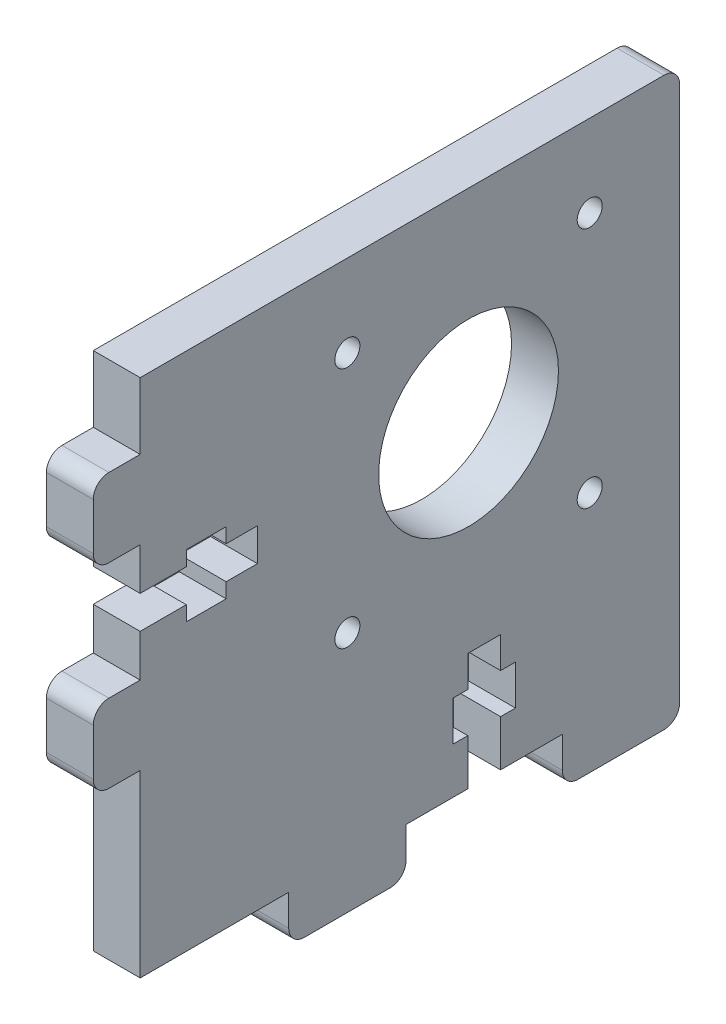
ISO-10303-21;
HEADER;
FILE_DESCRIPTION(('STEP AP214'),'2;1');
FILE_NAME('part.step','',(''),(''),'','','');
FILE_SCHEMA(('AUTOMOTIVE_DESIGN { 1 0 10303 214 1 1 1 1 }'));
ENDSEC;
DATA;
#1=APPLICATION_CONTEXT('core data for automotive mechanical design processes');
#2=APPLICATION_PROTOCOL_DEFINITION('international standard','automotive_design',2000,#1);
#3=PRODUCT_CONTEXT('',#1,'mechanical');
#4=PRODUCT('Part','Part','',(#3));
#5=PRODUCT_RELATED_PRODUCT_CATEGORY('part','',(#4));
#6=PRODUCT_DEFINITION_FORMATION('','',#4);
#7=PRODUCT_DEFINITION_CONTEXT('part definition',#1,'design');
#8=PRODUCT_DEFINITION('design','',#6,#7);
#9=PRODUCT_DEFINITION_SHAPE('','',#8);
#10=(LENGTH_UNIT() NAMED_UNIT(*) SI_UNIT(.MILLI.,.METRE.));
#11=(NAMED_UNIT(*) PLANE_ANGLE_UNIT() SI_UNIT($,.RADIAN.));
#12=(NAMED_UNIT(*) SI_UNIT($,.STERADIAN.) SOLID_ANGLE_UNIT());
#13=UNCERTAINTY_MEASURE_WITH_UNIT(LENGTH_MEASURE(1.E-05),#10,'distance_accuracy_value','');
#14=(GEOMETRIC_REPRESENTATION_CONTEXT(3) GLOBAL_UNCERTAINTY_ASSIGNED_CONTEXT((#13)) GLOBAL_UNIT_ASSIGNED_CONTEXT((#10,
#11,#12)) REPRESENTATION_CONTEXT('',''));
#15=CARTESIAN_POINT('',(0.,0.,0.));
#16=DIRECTION('',(0.,0.,1.));
#17=DIRECTION('',(1.,0.,0.));
#18=AXIS2_PLACEMENT_3D('',#15,#16,#17);
#19=CARTESIAN_POINT('',(-71.3091859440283,-18.,-69.));
#20=DIRECTION('',(0.,-1.,0.));
#21=DIRECTION('',(0.,0.,-1.));
#22=AXIS2_PLACEMENT_3D('',#19,#20,#21);
#23=PLANE('',#22);
#24=DIRECTION('',(0.,0.,1.));
#25=VECTOR('',#24,1.);
#26=CARTESIAN_POINT('',(0.,-18.,-69.));
#27=LINE('',#26,#25);
#28=CARTESIAN_POINT('',(0.,-18.,-41.9));
#29=VERTEX_POINT('',#28);
#30=CARTESIAN_POINT('',(0.,-18.,-34.));
#31=VERTEX_POINT('',#30);
#32=EDGE_CURVE('E510',#29,#31,#27,.T.);
#33=ORIENTED_EDGE('',*,*,#32,.F.);
#34=DIRECTION('',(1.,0.,0.));
#35=VECTOR('',#34,1.);
#36=CARTESIAN_POINT('',(-4.99999999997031E-05,-18.,-41.9));
#37=LINE('',#36,#35);
#38=CARTESIAN_POINT('',(6.,-18.,-41.9));
#39=VERTEX_POINT('',#38);
#40=EDGE_CURVE('E430',#29,#39,#37,.T.);
#41=ORIENTED_EDGE('',*,*,#40,.T.);
#42=DIRECTION('',(0.,0.,-1.));
#43=VECTOR('',#42,1.);
#44=CARTESIAN_POINT('',(6.,-18.,-69.));
#45=LINE('',#44,#43);
#46=CARTESIAN_POINT('',(6.,-18.,-34.));
#47=VERTEX_POINT('',#46);
#48=EDGE_CURVE('E512',#47,#39,#45,.T.);
#49=ORIENTED_EDGE('',*,*,#48,.F.);
#50=DIRECTION('',(1.,0.,0.));
#51=VECTOR('',#50,1.);
#52=CARTESIAN_POINT('',(-16.1554944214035,-18.,-34.));
#53=LINE('',#52,#51);
#54=EDGE_CURVE('E460',#31,#47,#53,.T.);
#55=ORIENTED_EDGE('',*,*,#54,.F.);
#56=EDGE_LOOP('',(#33,#41,#49,#55));
#57=FACE_BOUND('',#56,.T.);
#58=ADVANCED_FACE('F37',(#57),#23,.T.);
#59=DIRECTION('',(1.,0.,0.));
#60=VECTOR('',#59,1.);
#61=CARTESIAN_POINT('',(-4.99999999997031E-05,-18.,-46.1));
#62=LINE('',#61,#60);
#63=CARTESIAN_POINT('',(0.,-18.,-46.1));
#64=VERTEX_POINT('',#63);
#65=CARTESIAN_POINT('',(6.,-18.,-46.1));
#66=VERTEX_POINT('',#65);
#67=EDGE_CURVE('E428',#64,#66,#62,.T.);
#68=ORIENTED_EDGE('',*,*,#67,.F.);
#69=CARTESIAN_POINT('',(0.,-18.,-54.));
#70=VERTEX_POINT('',#69);
#71=EDGE_CURVE('E524',#70,#64,#27,.T.);
#72=ORIENTED_EDGE('',*,*,#71,.F.);
#73=DIRECTION('',(1.,0.,0.));
#74=VECTOR('',#73,1.);
#75=CARTESIAN_POINT('',(-16.1554944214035,-18.,-54.));
#76=LINE('',#75,#74);
#77=CARTESIAN_POINT('',(6.,-18.,-54.));
#78=VERTEX_POINT('',#77);
#79=EDGE_CURVE('E486',#70,#78,#76,.T.);
#80=ORIENTED_EDGE('',*,*,#79,.T.);
#81=EDGE_CURVE('E41',#66,#78,#45,.T.);
#82=ORIENTED_EDGE('',*,*,#81,.F.);
#83=EDGE_LOOP('',(#68,#72,#80,#82));
#84=FACE_BOUND('',#83,.T.);
#85=ADVANCED_FACE('F538',(#84),#23,.T.);
#86=DIRECTION('',(1.,0.,0.));
#87=VECTOR('',#86,1.);
#88=CARTESIAN_POINT('',(-16.1554944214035,-18.,-19.));
#89=LINE('',#88,#87);
#90=CARTESIAN_POINT('',(0.,-18.,-19.));
#91=VERTEX_POINT('',#90);
#92=CARTESIAN_POINT('',(6.,-18.,-19.));
#93=VERTEX_POINT('',#92);
#94=EDGE_CURVE('E62',#91,#93,#89,.T.);
#95=ORIENTED_EDGE('',*,*,#94,.T.);
#96=CARTESIAN_POINT('',(6.,-18.,0.));
#97=VERTEX_POINT('',#96);
#98=EDGE_CURVE('E514',#97,#93,#45,.T.);
#99=ORIENTED_EDGE('',*,*,#98,.F.);
#100=DIRECTION('',(1.,0.,0.));
#101=VECTOR('',#100,1.);
#102=CARTESIAN_POINT('',(-71.3091859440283,-18.,0.));
#103=LINE('',#102,#101);
#104=CARTESIAN_POINT('',(0.,-18.,0.));
#105=VERTEX_POINT('',#104);
#106=EDGE_CURVE('E511',#105,#97,#103,.T.);
#107=ORIENTED_EDGE('',*,*,#106,.F.);
#108=EDGE_CURVE('E508',#91,#105,#27,.T.);
#109=ORIENTED_EDGE('',*,*,#108,.F.);
#110=EDGE_LOOP('',(#95,#99,#107,#109));
#111=FACE_BOUND('',#110,.T.);
#112=ADVANCED_FACE('F577',(#111),#23,.T.);
#113=CARTESIAN_POINT('',(6.,15.,0.));
#114=DIRECTION('',(0.,-1.,0.));
#115=DIRECTION('',(0.,0.,-1.));
#116=AXIS2_PLACEMENT_3D('',#113,#114,#115);
#117=PLANE('',#116);
#118=DIRECTION('',(0.,0.,1.));
#119=VECTOR('',#118,1.);
#120=CARTESIAN_POINT('',(0.,15.,0.));
#121=LINE('',#120,#119);
#122=CARTESIAN_POINT('',(0.,15.,0.));
#123=VERTEX_POINT('',#122);
#124=CARTESIAN_POINT('',(0.,15.,3.99999999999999));
#125=VERTEX_POINT('',#124);
#126=EDGE_CURVE('E800',#123,#125,#121,.T.);
#127=ORIENTED_EDGE('',*,*,#126,.T.);
#128=DIRECTION('',(-1.,0.,0.));
#129=VECTOR('',#128,1.);
#130=CARTESIAN_POINT('',(6.,15.,3.99999999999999));
#131=LINE('',#130,#129);
#132=CARTESIAN_POINT('',(6.,15.,3.99999999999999));
#133=VERTEX_POINT('',#132);
#134=EDGE_CURVE('E717',#133,#125,#131,.T.);
#135=ORIENTED_EDGE('',*,*,#134,.F.);
#136=DIRECTION('',(0.,0.,1.));
#137=VECTOR('',#136,1.);
#138=CARTESIAN_POINT('',(6.,15.,0.));
#139=LINE('',#138,#137);
#140=CARTESIAN_POINT('',(6.,15.,0.));
#141=VERTEX_POINT('',#140);
#142=EDGE_CURVE('E665',#141,#133,#139,.T.);
#143=ORIENTED_EDGE('',*,*,#142,.F.);
#144=DIRECTION('',(-1.,0.,0.));
#145=VECTOR('',#144,1.);
#146=CARTESIAN_POINT('',(6.,15.,0.));
#147=LINE('',#146,#145);
#148=EDGE_CURVE('E666',#141,#123,#147,.T.);
#149=ORIENTED_EDGE('',*,*,#148,.T.);
#150=EDGE_LOOP('',(#127,#135,#143,#149));
#151=FACE_BOUND('',#150,.T.);
#152=ADVANCED_FACE('F39',(#151),#117,.F.);
#153=CARTESIAN_POINT('',(6.,13.,4.));
#154=DIRECTION('',(-1.,0.,0.));
#155=DIRECTION('',(0.,0.,1.));
#156=AXIS2_PLACEMENT_3D('',#153,#154,#155);
#157=CYLINDRICAL_SURFACE('',#156,2.);
#158=CARTESIAN_POINT('',(0.,13.,4.));
#159=DIRECTION('',(1.,0.,0.));
#160=DIRECTION('',(0.,0.,-1.));
#161=AXIS2_PLACEMENT_3D('',#158,#159,#160);
#162=CIRCLE('',#161,2.);
#163=CARTESIAN_POINT('',(0.,13.,6.));
#164=VERTEX_POINT('',#163);
#165=EDGE_CURVE('E803',#125,#164,#162,.T.);
#166=ORIENTED_EDGE('',*,*,#165,.T.);
#167=DIRECTION('',(-1.,0.,0.));
#168=VECTOR('',#167,1.);
#169=CARTESIAN_POINT('',(6.,13.,6.));
#170=LINE('',#169,#168);
#171=CARTESIAN_POINT('',(6.,13.,6.));
#172=VERTEX_POINT('',#171);
#173=EDGE_CURVE('E715',#172,#164,#170,.T.);
#174=ORIENTED_EDGE('',*,*,#173,.F.);
#175=CARTESIAN_POINT('',(6.,13.,4.));
#176=DIRECTION('',(1.,0.,0.));
#177=DIRECTION('',(0.,0.,-1.));
#178=AXIS2_PLACEMENT_3D('',#175,#176,#177);
#179=CIRCLE('',#178,2.);
#180=EDGE_CURVE('E828',#133,#172,#179,.T.);
#181=ORIENTED_EDGE('',*,*,#180,.F.);
#182=ORIENTED_EDGE('',*,*,#134,.T.);
#183=EDGE_LOOP('',(#166,#174,#181,#182));
#184=FACE_BOUND('',#183,.T.);
#185=ADVANCED_FACE('F793',(#184),#157,.T.);
#186=CARTESIAN_POINT('',(6.,0.,6.));
#187=DIRECTION('',(0.,0.,-1.));
#188=DIRECTION('',(0.,1.,0.));
#189=AXIS2_PLACEMENT_3D('',#186,#187,#188);
#190=PLANE('',#189);
#191=DIRECTION('',(0.,-1.,0.));
#192=VECTOR('',#191,1.);
#193=CARTESIAN_POINT('',(0.,0.,6.));
#194=LINE('',#193,#192);
#195=CARTESIAN_POINT('',(0.,7.00000000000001,6.));
#196=VERTEX_POINT('',#195);
#197=EDGE_CURVE('E806',#164,#196,#194,.T.);
#198=ORIENTED_EDGE('',*,*,#197,.T.);
#199=DIRECTION('',(-1.,0.,0.));
#200=VECTOR('',#199,1.);
#201=CARTESIAN_POINT('',(6.,7.00000000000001,6.));
#202=LINE('',#201,#200);
#203=CARTESIAN_POINT('',(6.,7.00000000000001,6.));
#204=VERTEX_POINT('',#203);
#205=EDGE_CURVE('E713',#204,#196,#202,.T.);
#206=ORIENTED_EDGE('',*,*,#205,.F.);
#207=DIRECTION('',(0.,-1.,0.));
#208=VECTOR('',#207,1.);
#209=CARTESIAN_POINT('',(6.,0.,6.));
#210=LINE('',#209,#208);
#211=EDGE_CURVE('E827',#172,#204,#210,.T.);
#212=ORIENTED_EDGE('',*,*,#211,.F.);
#213=ORIENTED_EDGE('',*,*,#173,.T.);
#214=EDGE_LOOP('',(#198,#206,#212,#213));
#215=FACE_BOUND('',#214,.T.);
#216=ADVANCED_FACE('F798',(#215),#190,.F.);
#217=CARTESIAN_POINT('',(6.,7.,4.));
#218=DIRECTION('',(-1.,0.,0.));
#219=DIRECTION('',(0.,0.,1.));
#220=AXIS2_PLACEMENT_3D('',#217,#218,#219);
#221=CYLINDRICAL_SURFACE('',#220,2.);
#222=CARTESIAN_POINT('',(0.,7.,4.));
#223=DIRECTION('',(1.,0.,0.));
#224=DIRECTION('',(0.,0.,-1.));
#225=AXIS2_PLACEMENT_3D('',#222,#223,#224);
#226=CIRCLE('',#225,2.);
#227=CARTESIAN_POINT('',(0.,5.,3.99999999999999));
#228=VERTEX_POINT('',#227);
#229=EDGE_CURVE('E604',#228,#196,#226,.F.);
#230=ORIENTED_EDGE('',*,*,#229,.F.);
#231=DIRECTION('',(-1.,0.,0.));
#232=VECTOR('',#231,1.);
#233=CARTESIAN_POINT('',(6.,5.,3.99999999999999));
#234=LINE('',#233,#232);
#235=CARTESIAN_POINT('',(6.,5.,3.99999999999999));
#236=VERTEX_POINT('',#235);
#237=EDGE_CURVE('E711',#236,#228,#234,.T.);
#238=ORIENTED_EDGE('',*,*,#237,.F.);
#239=CARTESIAN_POINT('',(6.,7.,4.));
#240=DIRECTION('',(1.,0.,0.));
#241=DIRECTION('',(0.,0.,-1.));
#242=AXIS2_PLACEMENT_3D('',#239,#240,#241);
#243=CIRCLE('',#242,2.);
#244=EDGE_CURVE('E823',#236,#204,#243,.F.);
#245=ORIENTED_EDGE('',*,*,#244,.T.);
#246=ORIENTED_EDGE('',*,*,#205,.T.);
#247=EDGE_LOOP('',(#230,#238,#245,#246));
#248=FACE_BOUND('',#247,.T.);
#249=ADVANCED_FACE('F820',(#248),#221,.T.);
#250=CARTESIAN_POINT('',(6.,5.,0.));
#251=DIRECTION('',(0.,-1.,0.));
#252=DIRECTION('',(0.,0.,-1.));
#253=AXIS2_PLACEMENT_3D('',#250,#251,#252);
#254=PLANE('',#253);
#255=DIRECTION('',(0.,0.,1.));
#256=VECTOR('',#255,1.);
#257=CARTESIAN_POINT('',(0.,5.,0.));
#258=LINE('',#257,#256);
#259=CARTESIAN_POINT('',(0.,5.,0.));
#260=VERTEX_POINT('',#259);
#261=EDGE_CURVE('E599',#260,#228,#258,.T.);
#262=ORIENTED_EDGE('',*,*,#261,.F.);
#263=DIRECTION('',(-1.,0.,0.));
#264=VECTOR('',#263,1.);
#265=CARTESIAN_POINT('',(6.,5.,0.));
#266=LINE('',#265,#264);
#267=CARTESIAN_POINT('',(6.,5.,0.));
#268=VERTEX_POINT('',#267);
#269=EDGE_CURVE('E595',#268,#260,#266,.T.);
#270=ORIENTED_EDGE('',*,*,#269,.F.);
#271=DIRECTION('',(0.,0.,1.));
#272=VECTOR('',#271,1.);
#273=CARTESIAN_POINT('',(6.,5.,0.));
#274=LINE('',#273,#272);
#275=EDGE_CURVE('E585',#268,#236,#274,.T.);
#276=ORIENTED_EDGE('',*,*,#275,.T.);
#277=ORIENTED_EDGE('',*,*,#237,.T.);
#278=EDGE_LOOP('',(#262,#270,#276,#277));
#279=FACE_BOUND('',#278,.T.);
#280=ADVANCED_FACE('F982',(#279),#254,.T.);
#281=CARTESIAN_POINT('',(6.,0.,0.));
#282=DIRECTION('',(0.,0.,1.));
#283=DIRECTION('',(1.,0.,0.));
#284=AXIS2_PLACEMENT_3D('',#281,#282,#283);
#285=PLANE('',#284);
#286=DIRECTION('',(0.,1.,0.));
#287=VECTOR('',#286,1.);
#288=CARTESIAN_POINT('',(0.,0.,0.));
#289=LINE('',#288,#287);
#290=EDGE_CURVE('E594',#105,#260,#289,.T.);
#291=ORIENTED_EDGE('',*,*,#290,.F.);
#292=ORIENTED_EDGE('',*,*,#106,.T.);
#293=DIRECTION('',(0.,1.,0.));
#294=VECTOR('',#293,1.);
#295=CARTESIAN_POINT('',(6.,0.,0.));
#296=LINE('',#295,#294);
#297=EDGE_CURVE('E581',#97,#268,#296,.T.);
#298=ORIENTED_EDGE('',*,*,#297,.T.);
#299=ORIENTED_EDGE('',*,*,#269,.T.);
#300=EDGE_LOOP('',(#291,#292,#298,#299));
#301=FACE_BOUND('',#300,.T.);
#302=ADVANCED_FACE('F592',(#301),#285,.T.);
#303=CARTESIAN_POINT('',(6.,0.,-69.));
#304=DIRECTION('',(0.,0.,1.));
#305=DIRECTION('',(0.,-1.,0.));
#306=AXIS2_PLACEMENT_3D('',#303,#304,#305);
#307=PLANE('',#306);
#308=DIRECTION('',(0.,1.,0.));
#309=VECTOR('',#308,1.);
#310=CARTESIAN_POINT('',(0.,0.,-69.));
#311=LINE('',#310,#309);
#312=CARTESIAN_POINT('',(0.,-22.,-69.));
#313=VERTEX_POINT('',#312);
#314=CARTESIAN_POINT('',(0.,46.5,-69.));
#315=VERTEX_POINT('',#314);
#316=EDGE_CURVE('E598',#313,#315,#311,.T.);
#317=ORIENTED_EDGE('',*,*,#316,.T.);
#318=DIRECTION('',(1.,0.,0.));
#319=VECTOR('',#318,1.);
#320=CARTESIAN_POINT('',(-71.3091859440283,46.5,-69.));
#321=LINE('',#320,#319);
#322=CARTESIAN_POINT('',(6.,46.5,-69.));
#323=VERTEX_POINT('',#322);
#324=EDGE_CURVE('E1440',#315,#323,#321,.T.);
#325=ORIENTED_EDGE('',*,*,#324,.T.);
#326=DIRECTION('',(0.,1.,0.));
#327=VECTOR('',#326,1.);
#328=CARTESIAN_POINT('',(6.,0.,-69.));
#329=LINE('',#328,#327);
#330=CARTESIAN_POINT('',(6.,-22.,-69.));
#331=VERTEX_POINT('',#330);
#332=EDGE_CURVE('E587',#331,#323,#329,.T.);
#333=ORIENTED_EDGE('',*,*,#332,.F.);
#334=DIRECTION('',(1.,0.,0.));
#335=VECTOR('',#334,1.);
#336=CARTESIAN_POINT('',(-16.1554944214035,-22.,-69.));
#337=LINE('',#336,#335);
#338=EDGE_CURVE('E487',#313,#331,#337,.T.);
#339=ORIENTED_EDGE('',*,*,#338,.F.);
#340=EDGE_LOOP('',(#317,#325,#333,#339));
#341=FACE_BOUND('',#340,.T.);
#342=ADVANCED_FACE('F978',(#341),#307,.F.);
#343=CARTESIAN_POINT('',(0.,40.,0.));
#344=VERTEX_POINT('',#343);
#345=CARTESIAN_POINT('',(0.,48.5,0.));
#346=VERTEX_POINT('',#345);
#347=EDGE_CURVE('E602',#344,#346,#289,.T.);
#348=ORIENTED_EDGE('',*,*,#347,.F.);
#349=DIRECTION('',(-1.,0.,0.));
#350=VECTOR('',#349,1.);
#351=CARTESIAN_POINT('',(6.,40.,0.));
#352=LINE('',#351,#350);
#353=CARTESIAN_POINT('',(6.,40.,0.));
#354=VERTEX_POINT('',#353);
#355=EDGE_CURVE('E708',#354,#344,#352,.T.);
#356=ORIENTED_EDGE('',*,*,#355,.F.);
#357=CARTESIAN_POINT('',(6.,48.5,0.));
#358=VERTEX_POINT('',#357);
#359=EDGE_CURVE('E590',#354,#358,#296,.T.);
#360=ORIENTED_EDGE('',*,*,#359,.T.);
#361=DIRECTION('',(1.,0.,0.));
#362=VECTOR('',#361,1.);
#363=CARTESIAN_POINT('',(-71.3091859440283,48.5,0.));
#364=LINE('',#363,#362);
#365=EDGE_CURVE('E1434',#346,#358,#364,.T.);
#366=ORIENTED_EDGE('',*,*,#365,.F.);
#367=EDGE_LOOP('',(#348,#356,#360,#366));
#368=FACE_BOUND('',#367,.T.);
#369=ADVANCED_FACE('F976',(#368),#285,.T.);
#370=CARTESIAN_POINT('',(6.,40.,0.));
#371=DIRECTION('',(0.,-1.,0.));
#372=DIRECTION('',(0.,0.,-1.));
#373=AXIS2_PLACEMENT_3D('',#370,#371,#372);
#374=PLANE('',#373);
#375=DIRECTION('',(0.,0.,1.));
#376=VECTOR('',#375,1.);
#377=CARTESIAN_POINT('',(0.,40.,0.));
#378=LINE('',#377,#376);
#379=CARTESIAN_POINT('',(0.,40.,3.99999999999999));
#380=VERTEX_POINT('',#379);
#381=EDGE_CURVE('E610',#344,#380,#378,.T.);
#382=ORIENTED_EDGE('',*,*,#381,.T.);
#383=DIRECTION('',(-1.,0.,0.));
#384=VECTOR('',#383,1.);
#385=CARTESIAN_POINT('',(6.,40.,3.99999999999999));
#386=LINE('',#385,#384);
#387=CARTESIAN_POINT('',(6.,40.,3.99999999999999));
#388=VERTEX_POINT('',#387);
#389=EDGE_CURVE('E705',#388,#380,#386,.T.);
#390=ORIENTED_EDGE('',*,*,#389,.F.);
#391=DIRECTION('',(0.,0.,1.));
#392=VECTOR('',#391,1.);
#393=CARTESIAN_POINT('',(6.,40.,0.));
#394=LINE('',#393,#392);
#395=EDGE_CURVE('E841',#354,#388,#394,.T.);
#396=ORIENTED_EDGE('',*,*,#395,.F.);
#397=ORIENTED_EDGE('',*,*,#355,.T.);
#398=EDGE_LOOP('',(#382,#390,#396,#397));
#399=FACE_BOUND('',#398,.T.);
#400=ADVANCED_FACE('F972',(#399),#374,.F.);
#401=CARTESIAN_POINT('',(6.,38.,4.));
#402=DIRECTION('',(-1.,0.,0.));
#403=DIRECTION('',(0.,0.,1.));
#404=AXIS2_PLACEMENT_3D('',#401,#402,#403);
#405=CYLINDRICAL_SURFACE('',#404,2.);
#406=CARTESIAN_POINT('',(0.,38.,4.));
#407=DIRECTION('',(1.,0.,0.));
#408=DIRECTION('',(0.,0.,-1.));
#409=AXIS2_PLACEMENT_3D('',#406,#407,#408);
#410=CIRCLE('',#409,2.);
#411=CARTESIAN_POINT('',(0.,38.,6.));
#412=VERTEX_POINT('',#411);
#413=EDGE_CURVE('E614',#380,#412,#410,.T.);
#414=ORIENTED_EDGE('',*,*,#413,.T.);
#415=DIRECTION('',(-1.,0.,0.));
#416=VECTOR('',#415,1.);
#417=CARTESIAN_POINT('',(6.,38.,6.));
#418=LINE('',#417,#416);
#419=CARTESIAN_POINT('',(6.,38.,6.));
#420=VERTEX_POINT('',#419);
#421=EDGE_CURVE('E702',#420,#412,#418,.T.);
#422=ORIENTED_EDGE('',*,*,#421,.F.);
#423=CARTESIAN_POINT('',(6.,38.,4.));
#424=DIRECTION('',(1.,0.,0.));
#425=DIRECTION('',(0.,0.,-1.));
#426=AXIS2_PLACEMENT_3D('',#423,#424,#425);
#427=CIRCLE('',#426,2.);
#428=EDGE_CURVE('E843',#388,#420,#427,.T.);
#429=ORIENTED_EDGE('',*,*,#428,.F.);
#430=ORIENTED_EDGE('',*,*,#389,.T.);
#431=EDGE_LOOP('',(#414,#422,#429,#430));
#432=FACE_BOUND('',#431,.T.);
#433=ADVANCED_FACE('F968',(#432),#405,.T.);
#434=CARTESIAN_POINT('',(6.,0.,5.99999999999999));
#435=DIRECTION('',(0.,0.,-1.));
#436=DIRECTION('',(0.,1.,0.));
#437=AXIS2_PLACEMENT_3D('',#434,#435,#436);
#438=PLANE('',#437);
#439=DIRECTION('',(0.,-1.,0.));
#440=VECTOR('',#439,1.);
#441=CARTESIAN_POINT('',(0.,0.,5.99999999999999));
#442=LINE('',#441,#440);
#443=CARTESIAN_POINT('',(0.,32.,6.));
#444=VERTEX_POINT('',#443);
#445=EDGE_CURVE('E630',#412,#444,#442,.T.);
#446=ORIENTED_EDGE('',*,*,#445,.T.);
#447=DIRECTION('',(-1.,0.,0.));
#448=VECTOR('',#447,1.);
#449=CARTESIAN_POINT('',(6.,32.,6.));
#450=LINE('',#449,#448);
#451=CARTESIAN_POINT('',(6.,32.,6.));
#452=VERTEX_POINT('',#451);
#453=EDGE_CURVE('E700',#452,#444,#450,.T.);
#454=ORIENTED_EDGE('',*,*,#453,.F.);
#455=DIRECTION('',(0.,-1.,0.));
#456=VECTOR('',#455,1.);
#457=CARTESIAN_POINT('',(6.,0.,5.99999999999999));
#458=LINE('',#457,#456);
#459=EDGE_CURVE('E845',#420,#452,#458,.T.);
#460=ORIENTED_EDGE('',*,*,#459,.F.);
#461=ORIENTED_EDGE('',*,*,#421,.T.);
#462=EDGE_LOOP('',(#446,#454,#460,#461));
#463=FACE_BOUND('',#462,.T.);
#464=ADVANCED_FACE('F964',(#463),#438,.F.);
#465=CARTESIAN_POINT('',(6.,32.,4.));
#466=DIRECTION('',(-1.,0.,0.));
#467=DIRECTION('',(0.,0.,1.));
#468=AXIS2_PLACEMENT_3D('',#465,#466,#467);
#469=CYLINDRICAL_SURFACE('',#468,2.);
#470=CARTESIAN_POINT('',(0.,32.,4.));
#471=DIRECTION('',(1.,0.,0.));
#472=DIRECTION('',(0.,0.,-1.));
#473=AXIS2_PLACEMENT_3D('',#470,#471,#472);
#474=CIRCLE('',#473,2.);
#475=CARTESIAN_POINT('',(0.,30.,3.99999999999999));
#476=VERTEX_POINT('',#475);
#477=EDGE_CURVE('E626',#476,#444,#474,.F.);
#478=ORIENTED_EDGE('',*,*,#477,.F.);
#479=DIRECTION('',(-1.,0.,0.));
#480=VECTOR('',#479,1.);
#481=CARTESIAN_POINT('',(6.,30.,3.99999999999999));
#482=LINE('',#481,#480);
#483=CARTESIAN_POINT('',(6.,30.,3.99999999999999));
#484=VERTEX_POINT('',#483);
#485=EDGE_CURVE('E698',#484,#476,#482,.T.);
#486=ORIENTED_EDGE('',*,*,#485,.F.);
#487=CARTESIAN_POINT('',(6.,32.,4.));
#488=DIRECTION('',(1.,0.,0.));
#489=DIRECTION('',(0.,0.,-1.));
#490=AXIS2_PLACEMENT_3D('',#487,#488,#489);
#491=CIRCLE('',#490,2.);
#492=EDGE_CURVE('E847',#484,#452,#491,.F.);
#493=ORIENTED_EDGE('',*,*,#492,.T.);
#494=ORIENTED_EDGE('',*,*,#453,.T.);
#495=EDGE_LOOP('',(#478,#486,#493,#494));
#496=FACE_BOUND('',#495,.T.);
#497=ADVANCED_FACE('F960',(#496),#469,.T.);
#498=CARTESIAN_POINT('',(6.,30.,0.));
#499=DIRECTION('',(0.,-1.,0.));
#500=DIRECTION('',(0.,0.,-1.));
#501=AXIS2_PLACEMENT_3D('',#498,#499,#500);
#502=PLANE('',#501);
#503=DIRECTION('',(0.,0.,1.));
#504=VECTOR('',#503,1.);
#505=CARTESIAN_POINT('',(0.,30.,0.));
#506=LINE('',#505,#504);
#507=CARTESIAN_POINT('',(0.,30.,0.));
#508=VERTEX_POINT('',#507);
#509=EDGE_CURVE('E618',#508,#476,#506,.T.);
#510=ORIENTED_EDGE('',*,*,#509,.F.);
#511=DIRECTION('',(-1.,0.,0.));
#512=VECTOR('',#511,1.);
#513=CARTESIAN_POINT('',(6.,30.,0.));
#514=LINE('',#513,#512);
#515=CARTESIAN_POINT('',(6.,30.,0.));
#516=VERTEX_POINT('',#515);
#517=EDGE_CURVE('E696',#516,#508,#514,.T.);
#518=ORIENTED_EDGE('',*,*,#517,.F.);
#519=DIRECTION('',(0.,0.,1.));
#520=VECTOR('',#519,1.);
#521=CARTESIAN_POINT('',(6.,30.,0.));
#522=LINE('',#521,#520);
#523=EDGE_CURVE('E850',#516,#484,#522,.T.);
#524=ORIENTED_EDGE('',*,*,#523,.T.);
#525=ORIENTED_EDGE('',*,*,#485,.T.);
#526=EDGE_LOOP('',(#510,#518,#524,#525));
#527=FACE_BOUND('',#526,.T.);
#528=ADVANCED_FACE('F957',(#527),#502,.T.);
#529=CARTESIAN_POINT('',(0.,24.6,0.));
#530=VERTEX_POINT('',#529);
#531=EDGE_CURVE('E609',#530,#508,#289,.T.);
#532=ORIENTED_EDGE('',*,*,#531,.F.);
#533=DIRECTION('',(-1.,0.,0.));
#534=VECTOR('',#533,1.);
#535=CARTESIAN_POINT('',(6.,24.6,0.));
#536=LINE('',#535,#534);
#537=CARTESIAN_POINT('',(6.,24.6,0.));
#538=VERTEX_POINT('',#537);
#539=EDGE_CURVE('E694',#538,#530,#536,.T.);
#540=ORIENTED_EDGE('',*,*,#539,.F.);
#541=EDGE_CURVE('E853',#538,#516,#296,.T.);
#542=ORIENTED_EDGE('',*,*,#541,.T.);
#543=ORIENTED_EDGE('',*,*,#517,.T.);
#544=EDGE_LOOP('',(#532,#540,#542,#543));
#545=FACE_BOUND('',#544,.T.);
#546=ADVANCED_FACE('F925',(#545),#285,.T.);
#547=CARTESIAN_POINT('',(6.,24.6,0.));
#548=DIRECTION('',(0.,1.,0.));
#549=DIRECTION('',(0.,0.,1.));
#550=AXIS2_PLACEMENT_3D('',#547,#548,#549);
#551=PLANE('',#550);
#552=DIRECTION('',(0.,0.,-1.));
#553=VECTOR('',#552,1.);
#554=CARTESIAN_POINT('',(0.,24.6,0.));
#555=LINE('',#554,#553);
#556=CARTESIAN_POINT('',(0.,24.6,-5.89999999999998));
#557=VERTEX_POINT('',#556);
#558=EDGE_CURVE('E617',#530,#557,#555,.T.);
#559=ORIENTED_EDGE('',*,*,#558,.T.);
#560=DIRECTION('',(-1.,0.,0.));
#561=VECTOR('',#560,1.);
#562=CARTESIAN_POINT('',(6.,24.6,-5.89999999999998));
#563=LINE('',#562,#561);
#564=CARTESIAN_POINT('',(6.,24.6,-5.89999999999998));
#565=VERTEX_POINT('',#564);
#566=EDGE_CURVE('E692',#565,#557,#563,.T.);
#567=ORIENTED_EDGE('',*,*,#566,.F.);
#568=DIRECTION('',(0.,0.,-1.));
#569=VECTOR('',#568,1.);
#570=CARTESIAN_POINT('',(6.,24.6,0.));
#571=LINE('',#570,#569);
#572=EDGE_CURVE('E854',#538,#565,#571,.T.);
#573=ORIENTED_EDGE('',*,*,#572,.F.);
#574=ORIENTED_EDGE('',*,*,#539,.T.);
#575=EDGE_LOOP('',(#559,#567,#573,#574));
#576=FACE_BOUND('',#575,.T.);
#577=ADVANCED_FACE('F952',(#576),#551,.F.);
#578=CARTESIAN_POINT('',(6.,0.,-5.89999999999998));
#579=DIRECTION('',(0.,0.,-1.));
#580=DIRECTION('',(-1.,0.,0.));
#581=AXIS2_PLACEMENT_3D('',#578,#579,#580);
#582=PLANE('',#581);
#583=DIRECTION('',(0.,-1.,0.));
#584=VECTOR('',#583,1.);
#585=CARTESIAN_POINT('',(0.,0.,-5.89999999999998));
#586=LINE('',#585,#584);
#587=CARTESIAN_POINT('',(0.,26.5,-5.89999999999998));
#588=VERTEX_POINT('',#587);
#589=EDGE_CURVE('E623',#588,#557,#586,.T.);
#590=ORIENTED_EDGE('',*,*,#589,.F.);
#591=DIRECTION('',(-1.,0.,0.));
#592=VECTOR('',#591,1.);
#593=CARTESIAN_POINT('',(6.,26.5,-5.89999999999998));
#594=LINE('',#593,#592);
#595=CARTESIAN_POINT('',(6.,26.5,-5.89999999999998));
#596=VERTEX_POINT('',#595);
#597=EDGE_CURVE('E690',#596,#588,#594,.T.);
#598=ORIENTED_EDGE('',*,*,#597,.F.);
#599=DIRECTION('',(0.,-1.,0.));
#600=VECTOR('',#599,1.);
#601=CARTESIAN_POINT('',(6.,0.,-5.89999999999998));
#602=LINE('',#601,#600);
#603=EDGE_CURVE('E856',#596,#565,#602,.T.);
#604=ORIENTED_EDGE('',*,*,#603,.T.);
#605=ORIENTED_EDGE('',*,*,#566,.T.);
#606=EDGE_LOOP('',(#590,#598,#604,#605));
#607=FACE_BOUND('',#606,.T.);
#608=ADVANCED_FACE('F935',(#607),#582,.T.);
#609=CARTESIAN_POINT('',(6.,26.5,0.));
#610=DIRECTION('',(0.,1.,0.));
#611=DIRECTION('',(0.,0.,1.));
#612=AXIS2_PLACEMENT_3D('',#609,#610,#611);
#613=PLANE('',#612);
#614=DIRECTION('',(0.,0.,-1.));
#615=VECTOR('',#614,1.);
#616=CARTESIAN_POINT('',(0.,26.5,0.));
#617=LINE('',#616,#615);
#618=CARTESIAN_POINT('',(0.,26.5,-11.));
#619=VERTEX_POINT('',#618);
#620=EDGE_CURVE('E636',#588,#619,#617,.T.);
#621=ORIENTED_EDGE('',*,*,#620,.T.);
#622=DIRECTION('',(-1.,0.,0.));
#623=VECTOR('',#622,1.);
#624=CARTESIAN_POINT('',(6.,26.5,-11.));
#625=LINE('',#624,#623);
#626=CARTESIAN_POINT('',(6.,26.5,-11.));
#627=VERTEX_POINT('',#626);
#628=EDGE_CURVE('E687',#627,#619,#625,.T.);
#629=ORIENTED_EDGE('',*,*,#628,.F.);
#630=DIRECTION('',(0.,0.,-1.));
#631=VECTOR('',#630,1.);
#632=CARTESIAN_POINT('',(6.,26.5,0.));
#633=LINE('',#632,#631);
#634=EDGE_CURVE('E860',#596,#627,#633,.T.);
#635=ORIENTED_EDGE('',*,*,#634,.F.);
#636=ORIENTED_EDGE('',*,*,#597,.T.);
#637=EDGE_LOOP('',(#621,#629,#635,#636));
#638=FACE_BOUND('',#637,.T.);
#639=ADVANCED_FACE('F953',(#638),#613,.F.);
#640=CARTESIAN_POINT('',(6.,0.,-11.));
#641=DIRECTION('',(0.,0.,-1.));
#642=DIRECTION('',(-1.,0.,0.));
#643=AXIS2_PLACEMENT_3D('',#640,#641,#642);
#644=PLANE('',#643);
#645=DIRECTION('',(0.,-1.,0.));
#646=VECTOR('',#645,1.);
#647=CARTESIAN_POINT('',(0.,0.,-11.));
#648=LINE('',#647,#646);
#649=CARTESIAN_POINT('',(0.,24.6,-11.));
#650=VERTEX_POINT('',#649);
#651=EDGE_CURVE('E639',#619,#650,#648,.T.);
#652=ORIENTED_EDGE('',*,*,#651,.T.);
#653=DIRECTION('',(-1.,0.,0.));
#654=VECTOR('',#653,1.);
#655=CARTESIAN_POINT('',(6.,24.6,-11.));
#656=LINE('',#655,#654);
#657=CARTESIAN_POINT('',(6.,24.6,-11.));
#658=VERTEX_POINT('',#657);
#659=EDGE_CURVE('E684',#658,#650,#656,.T.);
#660=ORIENTED_EDGE('',*,*,#659,.F.);
#661=DIRECTION('',(0.,-1.,0.));
#662=VECTOR('',#661,1.);
#663=CARTESIAN_POINT('',(6.,0.,-11.));
#664=LINE('',#663,#662);
#665=EDGE_CURVE('E863',#627,#658,#664,.T.);
#666=ORIENTED_EDGE('',*,*,#665,.F.);
#667=ORIENTED_EDGE('',*,*,#628,.T.);
#668=EDGE_LOOP('',(#652,#660,#666,#667));
#669=FACE_BOUND('',#668,.T.);
#670=ADVANCED_FACE('F943',(#669),#644,.F.);
#671=CARTESIAN_POINT('',(0.,24.6,-15.));
#672=VERTEX_POINT('',#671);
#673=EDGE_CURVE('E625',#650,#672,#555,.T.);
#674=ORIENTED_EDGE('',*,*,#673,.T.);
#675=DIRECTION('',(-1.,0.,0.));
#676=VECTOR('',#675,1.);
#677=CARTESIAN_POINT('',(6.,24.6,-15.));
#678=LINE('',#677,#676);
#679=CARTESIAN_POINT('',(6.,24.6,-15.));
#680=VERTEX_POINT('',#679);
#681=EDGE_CURVE('E681',#680,#672,#678,.T.);
#682=ORIENTED_EDGE('',*,*,#681,.F.);
#683=EDGE_CURVE('E857',#658,#680,#571,.T.);
#684=ORIENTED_EDGE('',*,*,#683,.F.);
#685=ORIENTED_EDGE('',*,*,#659,.T.);
#686=EDGE_LOOP('',(#674,#682,#684,#685));
#687=FACE_BOUND('',#686,.T.);
#688=ADVANCED_FACE('F947',(#687),#551,.F.);
#689=CARTESIAN_POINT('',(6.,0.,-15.));
#690=DIRECTION('',(0.,0.,-1.));
#691=DIRECTION('',(0.,1.,0.));
#692=AXIS2_PLACEMENT_3D('',#689,#690,#691);
#693=PLANE('',#692);
#694=DIRECTION('',(0.,-1.,0.));
#695=VECTOR('',#694,1.);
#696=CARTESIAN_POINT('',(0.,0.,-15.));
#697=LINE('',#696,#695);
#698=CARTESIAN_POINT('',(0.,20.4,-15.));
#699=VERTEX_POINT('',#698);
#700=EDGE_CURVE('E642',#672,#699,#697,.T.);
#701=ORIENTED_EDGE('',*,*,#700,.T.);
#702=DIRECTION('',(-1.,0.,0.));
#703=VECTOR('',#702,1.);
#704=CARTESIAN_POINT('',(6.,20.4,-15.));
#705=LINE('',#704,#703);
#706=CARTESIAN_POINT('',(6.,20.4,-15.));
#707=VERTEX_POINT('',#706);
#708=EDGE_CURVE('E679',#707,#699,#705,.T.);
#709=ORIENTED_EDGE('',*,*,#708,.F.);
#710=DIRECTION('',(0.,-1.,0.));
#711=VECTOR('',#710,1.);
#712=CARTESIAN_POINT('',(6.,0.,-15.));
#713=LINE('',#712,#711);
#714=EDGE_CURVE('E866',#680,#707,#713,.T.);
#715=ORIENTED_EDGE('',*,*,#714,.F.);
#716=ORIENTED_EDGE('',*,*,#681,.T.);
#717=EDGE_LOOP('',(#701,#709,#715,#716));
#718=FACE_BOUND('',#717,.T.);
#719=ADVANCED_FACE('F944',(#718),#693,.F.);
#720=CARTESIAN_POINT('',(6.,20.4,0.));
#721=DIRECTION('',(0.,1.,0.));
#722=DIRECTION('',(0.,0.,1.));
#723=AXIS2_PLACEMENT_3D('',#720,#721,#722);
#724=PLANE('',#723);
#725=DIRECTION('',(0.,0.,-1.));
#726=VECTOR('',#725,1.);
#727=CARTESIAN_POINT('',(0.,20.4,0.));
#728=LINE('',#727,#726);
#729=CARTESIAN_POINT('',(0.,20.4,-11.));
#730=VERTEX_POINT('',#729);
#731=EDGE_CURVE('E645',#730,#699,#728,.T.);
#732=ORIENTED_EDGE('',*,*,#731,.F.);
#733=DIRECTION('',(-1.,0.,0.));
#734=VECTOR('',#733,1.);
#735=CARTESIAN_POINT('',(6.,20.4,-11.));
#736=LINE('',#735,#734);
#737=CARTESIAN_POINT('',(6.,20.4,-11.));
#738=VERTEX_POINT('',#737);
#739=EDGE_CURVE('E677',#738,#730,#736,.T.);
#740=ORIENTED_EDGE('',*,*,#739,.F.);
#741=DIRECTION('',(0.,0.,-1.));
#742=VECTOR('',#741,1.);
#743=CARTESIAN_POINT('',(6.,20.4,0.));
#744=LINE('',#743,#742);
#745=EDGE_CURVE('E868',#738,#707,#744,.T.);
#746=ORIENTED_EDGE('',*,*,#745,.T.);
#747=ORIENTED_EDGE('',*,*,#708,.T.);
#748=EDGE_LOOP('',(#732,#740,#746,#747));
#749=FACE_BOUND('',#748,.T.);
#750=ADVANCED_FACE('F930',(#749),#724,.T.);
#751=CARTESIAN_POINT('',(0.,18.5,-11.));
#752=VERTEX_POINT('',#751);
#753=EDGE_CURVE('E641',#730,#752,#648,.T.);
#754=ORIENTED_EDGE('',*,*,#753,.T.);
#755=DIRECTION('',(-1.,0.,0.));
#756=VECTOR('',#755,1.);
#757=CARTESIAN_POINT('',(6.,18.5,-11.));
#758=LINE('',#757,#756);
#759=CARTESIAN_POINT('',(6.,18.5,-11.));
#760=VERTEX_POINT('',#759);
#761=EDGE_CURVE('E675',#760,#752,#758,.T.);
#762=ORIENTED_EDGE('',*,*,#761,.F.);
#763=EDGE_CURVE('E865',#738,#760,#664,.T.);
#764=ORIENTED_EDGE('',*,*,#763,.F.);
#765=ORIENTED_EDGE('',*,*,#739,.T.);
#766=EDGE_LOOP('',(#754,#762,#764,#765));
#767=FACE_BOUND('',#766,.T.);
#768=ADVANCED_FACE('F938',(#767),#644,.F.);
#769=CARTESIAN_POINT('',(6.,18.5,0.));
#770=DIRECTION('',(0.,1.,0.));
#771=DIRECTION('',(0.,0.,1.));
#772=AXIS2_PLACEMENT_3D('',#769,#770,#771);
#773=PLANE('',#772);
#774=DIRECTION('',(0.,0.,-1.));
#775=VECTOR('',#774,1.);
#776=CARTESIAN_POINT('',(0.,18.5,0.));
#777=LINE('',#776,#775);
#778=CARTESIAN_POINT('',(0.,18.5,-5.89999999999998));
#779=VERTEX_POINT('',#778);
#780=EDGE_CURVE('E648',#779,#752,#777,.T.);
#781=ORIENTED_EDGE('',*,*,#780,.F.);
#782=DIRECTION('',(-1.,0.,0.));
#783=VECTOR('',#782,1.);
#784=CARTESIAN_POINT('',(6.,18.5,-5.89999999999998));
#785=LINE('',#784,#783);
#786=CARTESIAN_POINT('',(6.,18.5,-5.89999999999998));
#787=VERTEX_POINT('',#786);
#788=EDGE_CURVE('E673',#787,#779,#785,.T.);
#789=ORIENTED_EDGE('',*,*,#788,.F.);
#790=DIRECTION('',(0.,0.,-1.));
#791=VECTOR('',#790,1.);
#792=CARTESIAN_POINT('',(6.,18.5,0.));
#793=LINE('',#792,#791);
#794=EDGE_CURVE('E872',#787,#760,#793,.T.);
#795=ORIENTED_EDGE('',*,*,#794,.T.);
#796=ORIENTED_EDGE('',*,*,#761,.T.);
#797=EDGE_LOOP('',(#781,#789,#795,#796));
#798=FACE_BOUND('',#797,.T.);
#799=ADVANCED_FACE('F933',(#798),#773,.T.);
#800=CARTESIAN_POINT('',(0.,20.4,-5.89999999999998));
#801=VERTEX_POINT('',#800);
#802=EDGE_CURVE('E637',#801,#779,#586,.T.);
#803=ORIENTED_EDGE('',*,*,#802,.F.);
#804=DIRECTION('',(-1.,0.,0.));
#805=VECTOR('',#804,1.);
#806=CARTESIAN_POINT('',(6.,20.4,-5.89999999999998));
#807=LINE('',#806,#805);
#808=CARTESIAN_POINT('',(6.,20.4,-5.89999999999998));
#809=VERTEX_POINT('',#808);
#810=EDGE_CURVE('E671',#809,#801,#807,.T.);
#811=ORIENTED_EDGE('',*,*,#810,.F.);
#812=EDGE_CURVE('E861',#809,#787,#602,.T.);
#813=ORIENTED_EDGE('',*,*,#812,.T.);
#814=ORIENTED_EDGE('',*,*,#788,.T.);
#815=EDGE_LOOP('',(#803,#811,#813,#814));
#816=FACE_BOUND('',#815,.T.);
#817=ADVANCED_FACE('F928',(#816),#582,.T.);
#818=CARTESIAN_POINT('',(0.,20.4,0.));
#819=VERTEX_POINT('',#818);
#820=EDGE_CURVE('E608',#819,#801,#728,.T.);
#821=ORIENTED_EDGE('',*,*,#820,.F.);
#822=DIRECTION('',(-1.,0.,0.));
#823=VECTOR('',#822,1.);
#824=CARTESIAN_POINT('',(6.,20.4,0.));
#825=LINE('',#824,#823);
#826=CARTESIAN_POINT('',(6.,20.4,0.));
#827=VERTEX_POINT('',#826);
#828=EDGE_CURVE('E668',#827,#819,#825,.T.);
#829=ORIENTED_EDGE('',*,*,#828,.F.);
#830=EDGE_CURVE('E871',#827,#809,#744,.T.);
#831=ORIENTED_EDGE('',*,*,#830,.T.);
#832=ORIENTED_EDGE('',*,*,#810,.T.);
#833=EDGE_LOOP('',(#821,#829,#831,#832));
#834=FACE_BOUND('',#833,.T.);
#835=ADVANCED_FACE('F910',(#834),#724,.T.);
#836=CARTESIAN_POINT('',(6.,38.,-57.5));
#837=DIRECTION('',(-1.,0.,0.));
#838=DIRECTION('',(0.,0.,1.));
#839=AXIS2_PLACEMENT_3D('',#836,#837,#838);
#840=CYLINDRICAL_SURFACE('',#839,1.6);
#841=CARTESIAN_POINT('',(6.,38.,-57.5));
#842=DIRECTION('',(1.,0.,0.));
#843=DIRECTION('',(0.,0.,-1.));
#844=AXIS2_PLACEMENT_3D('',#841,#842,#843);
#845=CIRCLE('',#844,1.6);
#846=CARTESIAN_POINT('',(6.,38.,-59.1));
#847=VERTEX_POINT('',#846);
#848=EDGE_CURVE('E883',#847,#847,#845,.T.);
#849=ORIENTED_EDGE('',*,*,#848,.T.);
#850=EDGE_LOOP('',(#849));
#851=FACE_BOUND('',#850,.T.);
#852=CARTESIAN_POINT('',(0.,38.,-57.5));
#853=DIRECTION('',(1.,0.,0.));
#854=DIRECTION('',(0.,0.,-1.));
#855=AXIS2_PLACEMENT_3D('',#852,#853,#854);
#856=CIRCLE('',#855,1.6);
#857=CARTESIAN_POINT('',(0.,38.,-59.1));
#858=VERTEX_POINT('',#857);
#859=EDGE_CURVE('E659',#858,#858,#856,.T.);
#860=ORIENTED_EDGE('',*,*,#859,.F.);
#861=EDGE_LOOP('',(#860));
#862=FACE_BOUND('',#861,.T.);
#863=ADVANCED_FACE('F906',(#851,#862),#840,.F.);
#864=CARTESIAN_POINT('',(6.,7.00000000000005,-26.5));
#865=DIRECTION('',(-1.,0.,0.));
#866=DIRECTION('',(0.,0.,1.));
#867=AXIS2_PLACEMENT_3D('',#864,#865,#866);
#868=CYLINDRICAL_SURFACE('',#867,1.6);
#869=CARTESIAN_POINT('',(6.,7.00000000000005,-26.5));
#870=DIRECTION('',(1.,0.,0.));
#871=DIRECTION('',(0.,0.,-1.));
#872=AXIS2_PLACEMENT_3D('',#869,#870,#871);
#873=CIRCLE('',#872,1.6);
#874=CARTESIAN_POINT('',(6.,7.00000000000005,-28.1));
#875=VERTEX_POINT('',#874);
#876=EDGE_CURVE('E881',#875,#875,#873,.T.);
#877=ORIENTED_EDGE('',*,*,#876,.T.);
#878=EDGE_LOOP('',(#877));
#879=FACE_BOUND('',#878,.T.);
#880=CARTESIAN_POINT('',(0.,7.00000000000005,-26.5));
#881=DIRECTION('',(1.,0.,0.));
#882=DIRECTION('',(0.,0.,-1.));
#883=AXIS2_PLACEMENT_3D('',#880,#881,#882);
#884=CIRCLE('',#883,1.6);
#885=CARTESIAN_POINT('',(0.,7.00000000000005,-28.1));
#886=VERTEX_POINT('',#885);
#887=EDGE_CURVE('E656',#886,#886,#884,.T.);
#888=ORIENTED_EDGE('',*,*,#887,.F.);
#889=EDGE_LOOP('',(#888));
#890=FACE_BOUND('',#889,.T.);
#891=ADVANCED_FACE('F909',(#879,#890),#868,.F.);
#892=CARTESIAN_POINT('',(6.,7.00000000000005,-57.5));
#893=DIRECTION('',(-1.,0.,0.));
#894=DIRECTION('',(0.,0.,1.));
#895=AXIS2_PLACEMENT_3D('',#892,#893,#894);
#896=CYLINDRICAL_SURFACE('',#895,1.6);
#897=CARTESIAN_POINT('',(6.,7.00000000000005,-57.5));
#898=DIRECTION('',(1.,0.,0.));
#899=DIRECTION('',(0.,0.,-1.));
#900=AXIS2_PLACEMENT_3D('',#897,#898,#899);
#901=CIRCLE('',#900,1.6);
#902=CARTESIAN_POINT('',(6.,7.00000000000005,-59.1));
#903=VERTEX_POINT('',#902);
#904=EDGE_CURVE('E878',#903,#903,#901,.T.);
#905=ORIENTED_EDGE('',*,*,#904,.T.);
#906=EDGE_LOOP('',(#905));
#907=FACE_BOUND('',#906,.T.);
#908=CARTESIAN_POINT('',(0.,7.00000000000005,-57.5));
#909=DIRECTION('',(1.,0.,0.));
#910=DIRECTION('',(0.,0.,-1.));
#911=AXIS2_PLACEMENT_3D('',#908,#909,#910);
#912=CIRCLE('',#911,1.6);
#913=CARTESIAN_POINT('',(0.,7.00000000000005,-59.1));
#914=VERTEX_POINT('',#913);
#915=EDGE_CURVE('E653',#914,#914,#912,.T.);
#916=ORIENTED_EDGE('',*,*,#915,.F.);
#917=EDGE_LOOP('',(#916));
#918=FACE_BOUND('',#917,.T.);
#919=ADVANCED_FACE('F913',(#907,#918),#896,.F.);
#920=CARTESIAN_POINT('',(6.,22.5,-42.));
#921=DIRECTION('',(-1.,0.,0.));
#922=DIRECTION('',(0.,0.,1.));
#923=AXIS2_PLACEMENT_3D('',#920,#921,#922);
#924=CYLINDRICAL_SURFACE('',#923,11.5);
#925=CARTESIAN_POINT('',(6.,22.5,-42.));
#926=DIRECTION('',(1.,0.,0.));
#927=DIRECTION('',(0.,0.,-1.));
#928=AXIS2_PLACEMENT_3D('',#925,#926,#927);
#929=CIRCLE('',#928,11.5);
#930=CARTESIAN_POINT('',(6.,22.5,-53.5));
#931=VERTEX_POINT('',#930);
#932=EDGE_CURVE('E875',#931,#931,#929,.T.);
#933=ORIENTED_EDGE('',*,*,#932,.T.);
#934=EDGE_LOOP('',(#933));
#935=FACE_BOUND('',#934,.T.);
#936=CARTESIAN_POINT('',(0.,22.5,-42.));
#937=DIRECTION('',(1.,0.,0.));
#938=DIRECTION('',(0.,0.,-1.));
#939=AXIS2_PLACEMENT_3D('',#936,#937,#938);
#940=CIRCLE('',#939,11.5);
#941=CARTESIAN_POINT('',(0.,22.5,-53.5));
#942=VERTEX_POINT('',#941);
#943=EDGE_CURVE('E607',#942,#942,#940,.T.);
#944=ORIENTED_EDGE('',*,*,#943,.F.);
#945=EDGE_LOOP('',(#944));
#946=FACE_BOUND('',#945,.T.);
#947=ADVANCED_FACE('F917',(#935,#946),#924,.F.);
#948=EDGE_CURVE('E601',#123,#819,#289,.T.);
#949=ORIENTED_EDGE('',*,*,#948,.F.);
#950=ORIENTED_EDGE('',*,*,#148,.F.);
#951=EDGE_CURVE('E589',#141,#827,#296,.T.);
#952=ORIENTED_EDGE('',*,*,#951,.T.);
#953=ORIENTED_EDGE('',*,*,#828,.T.);
#954=EDGE_LOOP('',(#949,#950,#952,#953));
#955=FACE_BOUND('',#954,.T.);
#956=ADVANCED_FACE('F901',(#955),#285,.T.);
#957=CARTESIAN_POINT('',(6.,38.,-26.5));
#958=DIRECTION('',(-1.,0.,0.));
#959=DIRECTION('',(0.,0.,1.));
#960=AXIS2_PLACEMENT_3D('',#957,#958,#959);
#961=CYLINDRICAL_SURFACE('',#960,1.60000000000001);
#962=CARTESIAN_POINT('',(6.,38.,-26.5));
#963=DIRECTION('',(1.,0.,0.));
#964=DIRECTION('',(0.,0.,-1.));
#965=AXIS2_PLACEMENT_3D('',#962,#963,#964);
#966=CIRCLE('',#965,1.60000000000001);
#967=CARTESIAN_POINT('',(6.,38.,-28.1));
#968=VERTEX_POINT('',#967);
#969=EDGE_CURVE('E669',#968,#968,#966,.T.);
#970=ORIENTED_EDGE('',*,*,#969,.T.);
#971=EDGE_LOOP('',(#970));
#972=FACE_BOUND('',#971,.T.);
#973=CARTESIAN_POINT('',(0.,38.,-26.5));
#974=DIRECTION('',(1.,0.,0.));
#975=DIRECTION('',(0.,0.,-1.));
#976=AXIS2_PLACEMENT_3D('',#973,#974,#975);
#977=CIRCLE('',#976,1.60000000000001);
#978=CARTESIAN_POINT('',(0.,38.,-28.1));
#979=VERTEX_POINT('',#978);
#980=EDGE_CURVE('E662',#979,#979,#977,.T.);
#981=ORIENTED_EDGE('',*,*,#980,.F.);
#982=EDGE_LOOP('',(#981));
#983=FACE_BOUND('',#982,.T.);
#984=ADVANCED_FACE('F890',(#972,#983),#961,.F.);
#985=CARTESIAN_POINT('',(6.,0.,0.));
#986=DIRECTION('',(1.,0.,0.));
#987=DIRECTION('',(0.,0.,-1.));
#988=AXIS2_PLACEMENT_3D('',#985,#986,#987);
#989=PLANE('',#988);
#990=DIRECTION('',(0.,1.,0.));
#991=VECTOR('',#990,1.);
#992=CARTESIAN_POINT('',(6.,0.,-46.1));
#993=LINE('',#992,#991);
#994=CARTESIAN_POINT('',(6.,-12.1,-46.1));
#995=VERTEX_POINT('',#994);
#996=EDGE_CURVE('E388',#66,#995,#993,.T.);
#997=ORIENTED_EDGE('',*,*,#996,.F.);
#998=ORIENTED_EDGE('',*,*,#81,.T.);
#999=DIRECTION('',(0.,-1.,0.));
#1000=VECTOR('',#999,1.);
#1001=CARTESIAN_POINT('',(6.,-18.,-54.));
#1002=LINE('',#1001,#1000);
#1003=CARTESIAN_POINT('',(6.,-22.,-54.));
#1004=VERTEX_POINT('',#1003);
#1005=EDGE_CURVE('E445',#78,#1004,#1002,.T.);
#1006=ORIENTED_EDGE('',*,*,#1005,.T.);
#1007=CARTESIAN_POINT('',(6.,-22.,-56.));
#1008=DIRECTION('',(1.,0.,0.));
#1009=DIRECTION('',(0.,0.,1.));
#1010=AXIS2_PLACEMENT_3D('',#1007,#1008,#1009);
#1011=CIRCLE('',#1010,2.);
#1012=CARTESIAN_POINT('',(6.,-24.,-56.));
#1013=VERTEX_POINT('',#1012);
#1014=EDGE_CURVE('E477',#1004,#1013,#1011,.T.);
#1015=ORIENTED_EDGE('',*,*,#1014,.T.);
#1016=DIRECTION('',(0.,0.,-1.));
#1017=VECTOR('',#1016,1.);
#1018=CARTESIAN_POINT('',(6.,-24.,-67.));
#1019=LINE('',#1018,#1017);
#1020=CARTESIAN_POINT('',(6.,-24.,-67.));
#1021=VERTEX_POINT('',#1020);
#1022=EDGE_CURVE('E480',#1013,#1021,#1019,.T.);
#1023=ORIENTED_EDGE('',*,*,#1022,.T.);
#1024=CARTESIAN_POINT('',(6.,-22.,-67.));
#1025=DIRECTION('',(1.,0.,0.));
#1026=DIRECTION('',(0.,0.,1.));
#1027=AXIS2_PLACEMENT_3D('',#1024,#1025,#1026);
#1028=CIRCLE('',#1027,2.);
#1029=EDGE_CURVE('E483',#1021,#331,#1028,.T.);
#1030=ORIENTED_EDGE('',*,*,#1029,.T.);
#1031=ORIENTED_EDGE('',*,*,#332,.T.);
#1032=CARTESIAN_POINT('',(6.,46.5,-67.));
#1033=DIRECTION('',(1.,0.,0.));
#1034=DIRECTION('',(0.,0.,-1.));
#1035=AXIS2_PLACEMENT_3D('',#1032,#1033,#1034);
#1036=CIRCLE('',#1035,2.);
#1037=CARTESIAN_POINT('',(6.,48.5,-66.9999999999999));
#1038=VERTEX_POINT('',#1037);
#1039=EDGE_CURVE('E541',#323,#1038,#1036,.T.);
#1040=ORIENTED_EDGE('',*,*,#1039,.T.);
#1041=DIRECTION('',(0.,0.,1.));
#1042=VECTOR('',#1041,1.);
#1043=CARTESIAN_POINT('',(6.,48.5,-66.9999999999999));
#1044=LINE('',#1043,#1042);
#1045=EDGE_CURVE('E543',#1038,#358,#1044,.T.);
#1046=ORIENTED_EDGE('',*,*,#1045,.T.);
#1047=ORIENTED_EDGE('',*,*,#359,.F.);
#1048=ORIENTED_EDGE('',*,*,#395,.T.);
#1049=ORIENTED_EDGE('',*,*,#428,.T.);
#1050=ORIENTED_EDGE('',*,*,#459,.T.);
#1051=ORIENTED_EDGE('',*,*,#492,.F.);
#1052=ORIENTED_EDGE('',*,*,#523,.F.);
#1053=ORIENTED_EDGE('',*,*,#541,.F.);
#1054=ORIENTED_EDGE('',*,*,#572,.T.);
#1055=ORIENTED_EDGE('',*,*,#603,.F.);
#1056=ORIENTED_EDGE('',*,*,#634,.T.);
#1057=ORIENTED_EDGE('',*,*,#665,.T.);
#1058=ORIENTED_EDGE('',*,*,#683,.T.);
#1059=ORIENTED_EDGE('',*,*,#714,.T.);
#1060=ORIENTED_EDGE('',*,*,#745,.F.);
#1061=ORIENTED_EDGE('',*,*,#763,.T.);
#1062=ORIENTED_EDGE('',*,*,#794,.F.);
#1063=ORIENTED_EDGE('',*,*,#812,.F.);
#1064=ORIENTED_EDGE('',*,*,#830,.F.);
#1065=ORIENTED_EDGE('',*,*,#951,.F.);
#1066=ORIENTED_EDGE('',*,*,#142,.T.);
#1067=ORIENTED_EDGE('',*,*,#180,.T.);
#1068=ORIENTED_EDGE('',*,*,#211,.T.);
#1069=ORIENTED_EDGE('',*,*,#244,.F.);
#1070=ORIENTED_EDGE('',*,*,#275,.F.);
#1071=ORIENTED_EDGE('',*,*,#297,.F.);
#1072=ORIENTED_EDGE('',*,*,#98,.T.);
#1073=DIRECTION('',(0.,-1.,0.));
#1074=VECTOR('',#1073,1.);
#1075=CARTESIAN_POINT('',(6.,-18.,-19.));
#1076=LINE('',#1075,#1074);
#1077=CARTESIAN_POINT('',(6.,-22.,-19.));
#1078=VERTEX_POINT('',#1077);
#1079=EDGE_CURVE('E448',#93,#1078,#1076,.T.);
#1080=ORIENTED_EDGE('',*,*,#1079,.T.);
#1081=CARTESIAN_POINT('',(6.,-22.,-21.));
#1082=DIRECTION('',(1.,0.,0.));
#1083=DIRECTION('',(0.,0.,1.));
#1084=AXIS2_PLACEMENT_3D('',#1081,#1082,#1083);
#1085=CIRCLE('',#1084,2.);
#1086=CARTESIAN_POINT('',(6.,-24.,-21.));
#1087=VERTEX_POINT('',#1086);
#1088=EDGE_CURVE('E451',#1078,#1087,#1085,.T.);
#1089=ORIENTED_EDGE('',*,*,#1088,.T.);
#1090=DIRECTION('',(0.,0.,-1.));
#1091=VECTOR('',#1090,1.);
#1092=CARTESIAN_POINT('',(6.,-24.,-32.));
#1093=LINE('',#1092,#1091);
#1094=CARTESIAN_POINT('',(6.,-24.,-32.));
#1095=VERTEX_POINT('',#1094);
#1096=EDGE_CURVE('E454',#1087,#1095,#1093,.T.);
#1097=ORIENTED_EDGE('',*,*,#1096,.T.);
#1098=CARTESIAN_POINT('',(6.,-22.,-32.));
#1099=DIRECTION('',(1.,0.,0.));
#1100=DIRECTION('',(0.,0.,1.));
#1101=AXIS2_PLACEMENT_3D('',#1098,#1099,#1100);
#1102=CIRCLE('',#1101,2.);
#1103=CARTESIAN_POINT('',(6.,-22.,-34.));
#1104=VERTEX_POINT('',#1103);
#1105=EDGE_CURVE('E457',#1095,#1104,#1102,.T.);
#1106=ORIENTED_EDGE('',*,*,#1105,.T.);
#1107=DIRECTION('',(0.,1.,0.));
#1108=VECTOR('',#1107,1.);
#1109=CARTESIAN_POINT('',(6.,-18.,-34.));
#1110=LINE('',#1109,#1108);
#1111=EDGE_CURVE('E413',#1104,#47,#1110,.T.);
#1112=ORIENTED_EDGE('',*,*,#1111,.T.);
#1113=ORIENTED_EDGE('',*,*,#48,.T.);
#1114=DIRECTION('',(0.,1.,0.));
#1115=VECTOR('',#1114,1.);
#1116=CARTESIAN_POINT('',(6.,0.,-41.9));
#1117=LINE('',#1116,#1115);
#1118=CARTESIAN_POINT('',(6.,-12.1,-41.9));
#1119=VERTEX_POINT('',#1118);
#1120=EDGE_CURVE('E386',#39,#1119,#1117,.T.);
#1121=ORIENTED_EDGE('',*,*,#1120,.T.);
#1122=DIRECTION('',(0.,0.,-1.));
#1123=VECTOR('',#1122,1.);
#1124=CARTESIAN_POINT('',(6.,-12.1,0.));
#1125=LINE('',#1124,#1123);
#1126=CARTESIAN_POINT('',(6.,-12.1,-40.));
#1127=VERTEX_POINT('',#1126);
#1128=EDGE_CURVE('E365',#1127,#1119,#1125,.T.);
#1129=ORIENTED_EDGE('',*,*,#1128,.F.);
#1130=DIRECTION('',(0.,-1.,0.));
#1131=VECTOR('',#1130,1.);
#1132=CARTESIAN_POINT('',(6.,0.,-40.));
#1133=LINE('',#1132,#1131);
#1134=CARTESIAN_POINT('',(6.,-7.00000000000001,-40.));
#1135=VERTEX_POINT('',#1134);
#1136=EDGE_CURVE('E374',#1135,#1127,#1133,.T.);
#1137=ORIENTED_EDGE('',*,*,#1136,.F.);
#1138=DIRECTION('',(0.,0.,-1.));
#1139=VECTOR('',#1138,1.);
#1140=CARTESIAN_POINT('',(6.,-7.00000000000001,0.));
#1141=LINE('',#1140,#1139);
#1142=CARTESIAN_POINT('',(6.,-7.00000000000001,-41.9));
#1143=VERTEX_POINT('',#1142);
#1144=EDGE_CURVE('E371',#1135,#1143,#1141,.T.);
#1145=ORIENTED_EDGE('',*,*,#1144,.T.);
#1146=DIRECTION('',(0.,1.,0.));
#1147=VECTOR('',#1146,1.);
#1148=CARTESIAN_POINT('',(6.,0.,-41.9));
#1149=LINE('',#1148,#1147);
#1150=CARTESIAN_POINT('',(6.,-3.00000000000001,-41.9));
#1151=VERTEX_POINT('',#1150);
#1152=EDGE_CURVE('E408',#1143,#1151,#1149,.T.);
#1153=ORIENTED_EDGE('',*,*,#1152,.T.);
#1154=DIRECTION('',(0.,0.,-1.));
#1155=VECTOR('',#1154,1.);
#1156=CARTESIAN_POINT('',(6.,-3.00000000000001,0.));
#1157=LINE('',#1156,#1155);
#1158=CARTESIAN_POINT('',(6.,-3.00000000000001,-46.1));
#1159=VERTEX_POINT('',#1158);
#1160=EDGE_CURVE('E405',#1151,#1159,#1157,.T.);
#1161=ORIENTED_EDGE('',*,*,#1160,.T.);
#1162=DIRECTION('',(0.,1.,0.));
#1163=VECTOR('',#1162,1.);
#1164=CARTESIAN_POINT('',(6.,0.,-46.1));
#1165=LINE('',#1164,#1163);
#1166=CARTESIAN_POINT('',(6.,-7.00000000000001,-46.1));
#1167=VERTEX_POINT('',#1166);
#1168=EDGE_CURVE('E402',#1167,#1159,#1165,.T.);
#1169=ORIENTED_EDGE('',*,*,#1168,.F.);
#1170=DIRECTION('',(0.,0.,-1.));
#1171=VECTOR('',#1170,1.);
#1172=CARTESIAN_POINT('',(6.,-7.00000000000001,0.));
#1173=LINE('',#1172,#1171);
#1174=CARTESIAN_POINT('',(6.,-7.00000000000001,-48.));
#1175=VERTEX_POINT('',#1174);
#1176=EDGE_CURVE('E399',#1167,#1175,#1173,.T.);
#1177=ORIENTED_EDGE('',*,*,#1176,.T.);
#1178=DIRECTION('',(0.,-1.,0.));
#1179=VECTOR('',#1178,1.);
#1180=CARTESIAN_POINT('',(6.,0.,-48.));
#1181=LINE('',#1180,#1179);
#1182=CARTESIAN_POINT('',(6.,-12.1,-48.));
#1183=VERTEX_POINT('',#1182);
#1184=EDGE_CURVE('E396',#1175,#1183,#1181,.T.);
#1185=ORIENTED_EDGE('',*,*,#1184,.T.);
#1186=DIRECTION('',(0.,0.,-1.));
#1187=VECTOR('',#1186,1.);
#1188=CARTESIAN_POINT('',(6.,-12.1,0.));
#1189=LINE('',#1188,#1187);
#1190=EDGE_CURVE('E393',#995,#1183,#1189,.T.);
#1191=ORIENTED_EDGE('',*,*,#1190,.F.);
#1192=EDGE_LOOP('',(#997,#998,#1006,#1015,#1023,#1030,#1031,#1040,#1046,#1047,#1048,#1049,#1050,
#1051,#1052,#1053,#1054,#1055,#1056,#1057,#1058,#1059,#1060,#1061,#1062,#1063,#1064,#1065,#1066,
#1067,#1068,#1069,#1070,#1071,#1072,#1080,#1089,#1097,#1106,#1112,#1113,#1121,#1129,#1137,#1145,
#1153,#1161,#1169,#1177,#1185,#1191));
#1193=FACE_BOUND('',#1192,.T.);
#1194=ORIENTED_EDGE('',*,*,#932,.F.);
#1195=EDGE_LOOP('',(#1194));
#1196=FACE_BOUND('',#1195,.T.);
#1197=ORIENTED_EDGE('',*,*,#904,.F.);
#1198=EDGE_LOOP('',(#1197));
#1199=FACE_BOUND('',#1198,.T.);
#1200=ORIENTED_EDGE('',*,*,#876,.F.);
#1201=EDGE_LOOP('',(#1200));
#1202=FACE_BOUND('',#1201,.T.);
#1203=ORIENTED_EDGE('',*,*,#848,.F.);
#1204=EDGE_LOOP('',(#1203));
#1205=FACE_BOUND('',#1204,.T.);
#1206=ORIENTED_EDGE('',*,*,#969,.F.);
#1207=EDGE_LOOP('',(#1206));
#1208=FACE_BOUND('',#1207,.T.);
#1209=ADVANCED_FACE('F383',(#1193,#1196,#1199,#1202,#1205,#1208),#989,.T.);
#1210=CARTESIAN_POINT('',(0.,0.,0.));
#1211=DIRECTION('',(1.,0.,0.));
#1212=DIRECTION('',(0.,0.,-1.));
#1213=AXIS2_PLACEMENT_3D('',#1210,#1211,#1212);
#1214=PLANE('',#1213);
#1215=ORIENTED_EDGE('',*,*,#71,.T.);
#1216=DIRECTION('',(0.,1.,0.));
#1217=VECTOR('',#1216,1.);
#1218=CARTESIAN_POINT('',(0.,0.,-46.1));
#1219=LINE('',#1218,#1217);
#1220=CARTESIAN_POINT('',(0.,-12.1,-46.1));
#1221=VERTEX_POINT('',#1220);
#1222=EDGE_CURVE('E11',#64,#1221,#1219,.T.);
#1223=ORIENTED_EDGE('',*,*,#1222,.T.);
#1224=DIRECTION('',(0.,0.,-1.));
#1225=VECTOR('',#1224,1.);
#1226=CARTESIAN_POINT('',(0.,-12.1,0.));
#1227=LINE('',#1226,#1225);
#1228=CARTESIAN_POINT('',(0.,-12.1,-48.));
#1229=VERTEX_POINT('',#1228);
#1230=EDGE_CURVE('E47',#1221,#1229,#1227,.T.);
#1231=ORIENTED_EDGE('',*,*,#1230,.T.);
#1232=DIRECTION('',(0.,-1.,0.));
#1233=VECTOR('',#1232,1.);
#1234=CARTESIAN_POINT('',(0.,0.,-48.));
#1235=LINE('',#1234,#1233);
#1236=CARTESIAN_POINT('',(0.,-7.00000000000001,-48.));
#1237=VERTEX_POINT('',#1236);
#1238=EDGE_CURVE('E737',#1237,#1229,#1235,.T.);
#1239=ORIENTED_EDGE('',*,*,#1238,.F.);
#1240=DIRECTION('',(0.,0.,-1.));
#1241=VECTOR('',#1240,1.);
#1242=CARTESIAN_POINT('',(0.,-7.00000000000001,0.));
#1243=LINE('',#1242,#1241);
#1244=CARTESIAN_POINT('',(0.,-7.00000000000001,-46.1));
#1245=VERTEX_POINT('',#1244);
#1246=EDGE_CURVE('E735',#1245,#1237,#1243,.T.);
#1247=ORIENTED_EDGE('',*,*,#1246,.F.);
#1248=DIRECTION('',(0.,1.,0.));
#1249=VECTOR('',#1248,1.);
#1250=CARTESIAN_POINT('',(0.,0.,-46.1));
#1251=LINE('',#1250,#1249);
#1252=CARTESIAN_POINT('',(0.,-3.00000000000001,-46.1));
#1253=VERTEX_POINT('',#1252);
#1254=EDGE_CURVE('E732',#1245,#1253,#1251,.T.);
#1255=ORIENTED_EDGE('',*,*,#1254,.T.);
#1256=DIRECTION('',(0.,0.,-1.));
#1257=VECTOR('',#1256,1.);
#1258=CARTESIAN_POINT('',(0.,-3.00000000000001,0.));
#1259=LINE('',#1258,#1257);
#1260=CARTESIAN_POINT('',(0.,-3.00000000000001,-41.9));
#1261=VERTEX_POINT('',#1260);
#1262=EDGE_CURVE('E730',#1261,#1253,#1259,.T.);
#1263=ORIENTED_EDGE('',*,*,#1262,.F.);
#1264=DIRECTION('',(0.,1.,0.));
#1265=VECTOR('',#1264,1.);
#1266=CARTESIAN_POINT('',(0.,0.,-41.9));
#1267=LINE('',#1266,#1265);
#1268=CARTESIAN_POINT('',(0.,-7.00000000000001,-41.9));
#1269=VERTEX_POINT('',#1268);
#1270=EDGE_CURVE('E728',#1269,#1261,#1267,.T.);
#1271=ORIENTED_EDGE('',*,*,#1270,.F.);
#1272=DIRECTION('',(0.,0.,-1.));
#1273=VECTOR('',#1272,1.);
#1274=CARTESIAN_POINT('',(0.,-7.00000000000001,0.));
#1275=LINE('',#1274,#1273);
#1276=CARTESIAN_POINT('',(0.,-7.00000000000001,-40.));
#1277=VERTEX_POINT('',#1276);
#1278=EDGE_CURVE('E726',#1277,#1269,#1275,.T.);
#1279=ORIENTED_EDGE('',*,*,#1278,.F.);
#1280=DIRECTION('',(0.,-1.,0.));
#1281=VECTOR('',#1280,1.);
#1282=CARTESIAN_POINT('',(0.,0.,-40.));
#1283=LINE('',#1282,#1281);
#1284=CARTESIAN_POINT('',(0.,-12.1,-40.));
#1285=VERTEX_POINT('',#1284);
#1286=EDGE_CURVE('E722',#1277,#1285,#1283,.T.);
#1287=ORIENTED_EDGE('',*,*,#1286,.T.);
#1288=DIRECTION('',(0.,0.,-1.));
#1289=VECTOR('',#1288,1.);
#1290=CARTESIAN_POINT('',(0.,-12.1,0.));
#1291=LINE('',#1290,#1289);
#1292=CARTESIAN_POINT('',(0.,-12.1,-41.9));
#1293=VERTEX_POINT('',#1292);
#1294=EDGE_CURVE('E368',#1285,#1293,#1291,.T.);
#1295=ORIENTED_EDGE('',*,*,#1294,.T.);
#1296=DIRECTION('',(0.,1.,0.));
#1297=VECTOR('',#1296,1.);
#1298=CARTESIAN_POINT('',(0.,0.,-41.9));
#1299=LINE('',#1298,#1297);
#1300=EDGE_CURVE('E551',#29,#1293,#1299,.T.);
#1301=ORIENTED_EDGE('',*,*,#1300,.F.);
#1302=ORIENTED_EDGE('',*,*,#32,.T.);
#1303=DIRECTION('',(0.,-1.,0.));
#1304=VECTOR('',#1303,1.);
#1305=CARTESIAN_POINT('',(0.,-18.,-34.));
#1306=LINE('',#1305,#1304);
#1307=CARTESIAN_POINT('',(0.,-22.,-34.));
#1308=VERTEX_POINT('',#1307);
#1309=EDGE_CURVE('E443',#31,#1308,#1306,.T.);
#1310=ORIENTED_EDGE('',*,*,#1309,.T.);
#1311=CARTESIAN_POINT('',(0.,-22.,-32.));
#1312=DIRECTION('',(1.,0.,0.));
#1313=DIRECTION('',(0.,0.,-1.));
#1314=AXIS2_PLACEMENT_3D('',#1311,#1312,#1313);
#1315=CIRCLE('',#1314,2.);
#1316=CARTESIAN_POINT('',(0.,-24.,-32.));
#1317=VERTEX_POINT('',#1316);
#1318=EDGE_CURVE('E441',#1308,#1317,#1315,.F.);
#1319=ORIENTED_EDGE('',*,*,#1318,.T.);
#1320=DIRECTION('',(0.,0.,1.));
#1321=VECTOR('',#1320,1.);
#1322=CARTESIAN_POINT('',(0.,-24.,-32.));
#1323=LINE('',#1322,#1321);
#1324=CARTESIAN_POINT('',(0.,-24.,-21.));
#1325=VERTEX_POINT('',#1324);
#1326=EDGE_CURVE('E439',#1317,#1325,#1323,.T.);
#1327=ORIENTED_EDGE('',*,*,#1326,.T.);
#1328=CARTESIAN_POINT('',(0.,-22.,-21.));
#1329=DIRECTION('',(1.,0.,0.));
#1330=DIRECTION('',(0.,0.,-1.));
#1331=AXIS2_PLACEMENT_3D('',#1328,#1329,#1330);
#1332=CIRCLE('',#1331,2.);
#1333=CARTESIAN_POINT('',(0.,-22.,-19.));
#1334=VERTEX_POINT('',#1333);
#1335=EDGE_CURVE('E436',#1325,#1334,#1332,.F.);
#1336=ORIENTED_EDGE('',*,*,#1335,.T.);
#1337=DIRECTION('',(0.,1.,0.));
#1338=VECTOR('',#1337,1.);
#1339=CARTESIAN_POINT('',(0.,-18.,-19.));
#1340=LINE('',#1339,#1338);
#1341=EDGE_CURVE('E434',#1334,#91,#1340,.T.);
#1342=ORIENTED_EDGE('',*,*,#1341,.T.);
#1343=ORIENTED_EDGE('',*,*,#108,.T.);
#1344=ORIENTED_EDGE('',*,*,#290,.T.);
#1345=ORIENTED_EDGE('',*,*,#261,.T.);
#1346=ORIENTED_EDGE('',*,*,#229,.T.);
#1347=ORIENTED_EDGE('',*,*,#197,.F.);
#1348=ORIENTED_EDGE('',*,*,#165,.F.);
#1349=ORIENTED_EDGE('',*,*,#126,.F.);
#1350=ORIENTED_EDGE('',*,*,#948,.T.);
#1351=ORIENTED_EDGE('',*,*,#820,.T.);
#1352=ORIENTED_EDGE('',*,*,#802,.T.);
#1353=ORIENTED_EDGE('',*,*,#780,.T.);
#1354=ORIENTED_EDGE('',*,*,#753,.F.);
#1355=ORIENTED_EDGE('',*,*,#731,.T.);
#1356=ORIENTED_EDGE('',*,*,#700,.F.);
#1357=ORIENTED_EDGE('',*,*,#673,.F.);
#1358=ORIENTED_EDGE('',*,*,#651,.F.);
#1359=ORIENTED_EDGE('',*,*,#620,.F.);
#1360=ORIENTED_EDGE('',*,*,#589,.T.);
#1361=ORIENTED_EDGE('',*,*,#558,.F.);
#1362=ORIENTED_EDGE('',*,*,#531,.T.);
#1363=ORIENTED_EDGE('',*,*,#509,.T.);
#1364=ORIENTED_EDGE('',*,*,#477,.T.);
#1365=ORIENTED_EDGE('',*,*,#445,.F.);
#1366=ORIENTED_EDGE('',*,*,#413,.F.);
#1367=ORIENTED_EDGE('',*,*,#381,.F.);
#1368=ORIENTED_EDGE('',*,*,#347,.T.);
#1369=DIRECTION('',(0.,0.,-1.));
#1370=VECTOR('',#1369,1.);
#1371=CARTESIAN_POINT('',(0.,48.5,-66.9999999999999));
#1372=LINE('',#1371,#1370);
#1373=CARTESIAN_POINT('',(0.,48.5,-66.9999999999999));
#1374=VERTEX_POINT('',#1373);
#1375=EDGE_CURVE('E809',#346,#1374,#1372,.T.);
#1376=ORIENTED_EDGE('',*,*,#1375,.T.);
#1377=CARTESIAN_POINT('',(0.,46.5,-67.));
#1378=DIRECTION('',(1.,0.,0.));
#1379=DIRECTION('',(0.,0.,-1.));
#1380=AXIS2_PLACEMENT_3D('',#1377,#1378,#1379);
#1381=CIRCLE('',#1380,2.);
#1382=EDGE_CURVE('E804',#1374,#315,#1381,.F.);
#1383=ORIENTED_EDGE('',*,*,#1382,.T.);
#1384=ORIENTED_EDGE('',*,*,#316,.F.);
#1385=CARTESIAN_POINT('',(0.,-22.,-67.));
#1386=DIRECTION('',(1.,0.,0.));
#1387=DIRECTION('',(0.,0.,-1.));
#1388=AXIS2_PLACEMENT_3D('',#1385,#1386,#1387);
#1389=CIRCLE('',#1388,2.);
#1390=CARTESIAN_POINT('',(0.,-24.,-67.));
#1391=VERTEX_POINT('',#1390);
#1392=EDGE_CURVE('E475',#313,#1391,#1389,.F.);
#1393=ORIENTED_EDGE('',*,*,#1392,.T.);
#1394=DIRECTION('',(0.,0.,1.));
#1395=VECTOR('',#1394,1.);
#1396=CARTESIAN_POINT('',(0.,-24.,-67.));
#1397=LINE('',#1396,#1395);
#1398=CARTESIAN_POINT('',(0.,-24.,-56.));
#1399=VERTEX_POINT('',#1398);
#1400=EDGE_CURVE('E472',#1391,#1399,#1397,.T.);
#1401=ORIENTED_EDGE('',*,*,#1400,.T.);
#1402=CARTESIAN_POINT('',(0.,-22.,-56.));
#1403=DIRECTION('',(1.,0.,0.));
#1404=DIRECTION('',(0.,0.,-1.));
#1405=AXIS2_PLACEMENT_3D('',#1402,#1403,#1404);
#1406=CIRCLE('',#1405,2.);
#1407=CARTESIAN_POINT('',(0.,-22.,-54.));
#1408=VERTEX_POINT('',#1407);
#1409=EDGE_CURVE('E470',#1399,#1408,#1406,.F.);
#1410=ORIENTED_EDGE('',*,*,#1409,.T.);
#1411=DIRECTION('',(0.,1.,0.));
#1412=VECTOR('',#1411,1.);
#1413=CARTESIAN_POINT('',(0.,-18.,-54.));
#1414=LINE('',#1413,#1412);
#1415=EDGE_CURVE('E473',#1408,#70,#1414,.T.);
#1416=ORIENTED_EDGE('',*,*,#1415,.T.);
#1417=EDGE_LOOP('',(#1215,#1223,#1231,#1239,#1247,#1255,#1263,#1271,#1279,#1287,#1295,#1301,
#1302,#1310,#1319,#1327,#1336,#1342,#1343,#1344,#1345,#1346,#1347,#1348,#1349,#1350,#1351,#1352,
#1353,#1354,#1355,#1356,#1357,#1358,#1359,#1360,#1361,#1362,#1363,#1364,#1365,#1366,#1367,#1368,
#1376,#1383,#1384,#1393,#1401,#1410,#1416));
#1418=FACE_BOUND('',#1417,.T.);
#1419=ORIENTED_EDGE('',*,*,#943,.T.);
#1420=EDGE_LOOP('',(#1419));
#1421=FACE_BOUND('',#1420,.T.);
#1422=ORIENTED_EDGE('',*,*,#915,.T.);
#1423=EDGE_LOOP('',(#1422));
#1424=FACE_BOUND('',#1423,.T.);
#1425=ORIENTED_EDGE('',*,*,#887,.T.);
#1426=EDGE_LOOP('',(#1425));
#1427=FACE_BOUND('',#1426,.T.);
#1428=ORIENTED_EDGE('',*,*,#859,.T.);
#1429=EDGE_LOOP('',(#1428));
#1430=FACE_BOUND('',#1429,.T.);
#1431=ORIENTED_EDGE('',*,*,#980,.T.);
#1432=EDGE_LOOP('',(#1431));
#1433=FACE_BOUND('',#1432,.T.);
#1434=ADVANCED_FACE('F548',(#1418,#1421,#1424,#1427,#1430,#1433),#1214,.F.);
#1435=CARTESIAN_POINT('',(-71.3091859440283,48.5,-66.9999999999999));
#1436=DIRECTION('',(0.,1.,0.));
#1437=DIRECTION('',(0.,0.,1.));
#1438=AXIS2_PLACEMENT_3D('',#1435,#1436,#1437);
#1439=PLANE('',#1438);
#1440=ORIENTED_EDGE('',*,*,#1375,.F.);
#1441=ORIENTED_EDGE('',*,*,#365,.T.);
#1442=ORIENTED_EDGE('',*,*,#1045,.F.);
#1443=DIRECTION('',(1.,0.,0.));
#1444=VECTOR('',#1443,1.);
#1445=CARTESIAN_POINT('',(-71.3091859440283,48.5,-66.9999999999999));
#1446=LINE('',#1445,#1444);
#1447=EDGE_CURVE('E1436',#1374,#1038,#1446,.T.);
#1448=ORIENTED_EDGE('',*,*,#1447,.F.);
#1449=EDGE_LOOP('',(#1440,#1441,#1442,#1448));
#1450=FACE_BOUND('',#1449,.T.);
#1451=ADVANCED_FACE('F899',(#1450),#1439,.T.);
#1452=CARTESIAN_POINT('',(-71.3091859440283,46.5,-67.));
#1453=DIRECTION('',(1.,0.,0.));
#1454=DIRECTION('',(0.,0.,-1.));
#1455=AXIS2_PLACEMENT_3D('',#1452,#1453,#1454);
#1456=CYLINDRICAL_SURFACE('',#1455,2.);
#1457=ORIENTED_EDGE('',*,*,#1382,.F.);
#1458=ORIENTED_EDGE('',*,*,#1447,.T.);
#1459=ORIENTED_EDGE('',*,*,#1039,.F.);
#1460=ORIENTED_EDGE('',*,*,#324,.F.);
#1461=EDGE_LOOP('',(#1457,#1458,#1459,#1460));
#1462=FACE_BOUND('',#1461,.T.);
#1463=ADVANCED_FACE('F904',(#1462),#1456,.T.);
#1464=CARTESIAN_POINT('',(-16.1554944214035,-22.,-67.));
#1465=DIRECTION('',(1.,0.,0.));
#1466=DIRECTION('',(0.,0.,-1.));
#1467=AXIS2_PLACEMENT_3D('',#1464,#1465,#1466);
#1468=CYLINDRICAL_SURFACE('',#1467,2.);
#1469=ORIENTED_EDGE('',*,*,#1392,.F.);
#1470=ORIENTED_EDGE('',*,*,#338,.T.);
#1471=ORIENTED_EDGE('',*,*,#1029,.F.);
#1472=DIRECTION('',(1.,0.,0.));
#1473=VECTOR('',#1472,1.);
#1474=CARTESIAN_POINT('',(-16.1554944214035,-24.,-67.));
#1475=LINE('',#1474,#1473);
#1476=EDGE_CURVE('E490',#1391,#1021,#1475,.T.);
#1477=ORIENTED_EDGE('',*,*,#1476,.F.);
#1478=EDGE_LOOP('',(#1469,#1470,#1471,#1477));
#1479=FACE_BOUND('',#1478,.T.);
#1480=ADVANCED_FACE('F1252',(#1479),#1468,.T.);
#1481=CARTESIAN_POINT('',(-16.1554944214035,-24.,-67.));
#1482=DIRECTION('',(0.,-1.,0.));
#1483=DIRECTION('',(0.,0.,-1.));
#1484=AXIS2_PLACEMENT_3D('',#1481,#1482,#1483);
#1485=PLANE('',#1484);
#1486=ORIENTED_EDGE('',*,*,#1400,.F.);
#1487=ORIENTED_EDGE('',*,*,#1476,.T.);
#1488=ORIENTED_EDGE('',*,*,#1022,.F.);
#1489=DIRECTION('',(1.,0.,0.));
#1490=VECTOR('',#1489,1.);
#1491=CARTESIAN_POINT('',(-16.1554944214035,-24.,-56.));
#1492=LINE('',#1491,#1490);
#1493=EDGE_CURVE('E492',#1399,#1013,#1492,.T.);
#1494=ORIENTED_EDGE('',*,*,#1493,.F.);
#1495=EDGE_LOOP('',(#1486,#1487,#1488,#1494));
#1496=FACE_BOUND('',#1495,.T.);
#1497=ADVANCED_FACE('F1257',(#1496),#1485,.T.);
#1498=CARTESIAN_POINT('',(-16.1554944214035,-22.,-56.));
#1499=DIRECTION('',(1.,0.,0.));
#1500=DIRECTION('',(0.,0.,-1.));
#1501=AXIS2_PLACEMENT_3D('',#1498,#1499,#1500);
#1502=CYLINDRICAL_SURFACE('',#1501,2.);
#1503=ORIENTED_EDGE('',*,*,#1409,.F.);
#1504=ORIENTED_EDGE('',*,*,#1493,.T.);
#1505=ORIENTED_EDGE('',*,*,#1014,.F.);
#1506=DIRECTION('',(1.,0.,0.));
#1507=VECTOR('',#1506,1.);
#1508=CARTESIAN_POINT('',(-16.1554944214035,-22.,-54.));
#1509=LINE('',#1508,#1507);
#1510=EDGE_CURVE('E494',#1408,#1004,#1509,.T.);
#1511=ORIENTED_EDGE('',*,*,#1510,.F.);
#1512=EDGE_LOOP('',(#1503,#1504,#1505,#1511));
#1513=FACE_BOUND('',#1512,.T.);
#1514=ADVANCED_FACE('F1266',(#1513),#1502,.T.);
#1515=CARTESIAN_POINT('',(-16.1554944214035,-18.,-54.));
#1516=DIRECTION('',(0.,0.,1.));
#1517=DIRECTION('',(0.,-1.,0.));
#1518=AXIS2_PLACEMENT_3D('',#1515,#1516,#1517);
#1519=PLANE('',#1518);
#1520=ORIENTED_EDGE('',*,*,#1415,.F.);
#1521=ORIENTED_EDGE('',*,*,#1510,.T.);
#1522=ORIENTED_EDGE('',*,*,#1005,.F.);
#1523=ORIENTED_EDGE('',*,*,#79,.F.);
#1524=EDGE_LOOP('',(#1520,#1521,#1522,#1523));
#1525=FACE_BOUND('',#1524,.T.);
#1526=ADVANCED_FACE('F533',(#1525),#1519,.T.);
#1527=CARTESIAN_POINT('',(-16.1554944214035,-18.,-34.));
#1528=DIRECTION('',(0.,0.,-1.));
#1529=DIRECTION('',(-1.,0.,0.));
#1530=AXIS2_PLACEMENT_3D('',#1527,#1528,#1529);
#1531=PLANE('',#1530);
#1532=ORIENTED_EDGE('',*,*,#1309,.F.);
#1533=ORIENTED_EDGE('',*,*,#54,.T.);
#1534=ORIENTED_EDGE('',*,*,#1111,.F.);
#1535=DIRECTION('',(1.,0.,0.));
#1536=VECTOR('',#1535,1.);
#1537=CARTESIAN_POINT('',(-16.1554944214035,-22.,-34.));
#1538=LINE('',#1537,#1536);
#1539=EDGE_CURVE('E437',#1308,#1104,#1538,.T.);
#1540=ORIENTED_EDGE('',*,*,#1539,.F.);
#1541=EDGE_LOOP('',(#1532,#1533,#1534,#1540));
#1542=FACE_BOUND('',#1541,.T.);
#1543=ADVANCED_FACE('F556',(#1542),#1531,.T.);
#1544=CARTESIAN_POINT('',(-16.1554944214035,-22.,-32.));
#1545=DIRECTION('',(1.,0.,0.));
#1546=DIRECTION('',(0.,0.,-1.));
#1547=AXIS2_PLACEMENT_3D('',#1544,#1545,#1546);
#1548=CYLINDRICAL_SURFACE('',#1547,2.);
#1549=ORIENTED_EDGE('',*,*,#1318,.F.);
#1550=ORIENTED_EDGE('',*,*,#1539,.T.);
#1551=ORIENTED_EDGE('',*,*,#1105,.F.);
#1552=DIRECTION('',(1.,0.,0.));
#1553=VECTOR('',#1552,1.);
#1554=CARTESIAN_POINT('',(-16.1554944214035,-24.,-32.));
#1555=LINE('',#1554,#1553);
#1556=EDGE_CURVE('E462',#1317,#1095,#1555,.T.);
#1557=ORIENTED_EDGE('',*,*,#1556,.F.);
#1558=EDGE_LOOP('',(#1549,#1550,#1551,#1557));
#1559=FACE_BOUND('',#1558,.T.);
#1560=ADVANCED_FACE('F563',(#1559),#1548,.T.);
#1561=CARTESIAN_POINT('',(-16.1554944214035,-24.,-32.));
#1562=DIRECTION('',(0.,-1.,0.));
#1563=DIRECTION('',(0.,0.,-1.));
#1564=AXIS2_PLACEMENT_3D('',#1561,#1562,#1563);
#1565=PLANE('',#1564);
#1566=ORIENTED_EDGE('',*,*,#1326,.F.);
#1567=ORIENTED_EDGE('',*,*,#1556,.T.);
#1568=ORIENTED_EDGE('',*,*,#1096,.F.);
#1569=DIRECTION('',(1.,0.,0.));
#1570=VECTOR('',#1569,1.);
#1571=CARTESIAN_POINT('',(-16.1554944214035,-24.,-21.));
#1572=LINE('',#1571,#1570);
#1573=EDGE_CURVE('E464',#1325,#1087,#1572,.T.);
#1574=ORIENTED_EDGE('',*,*,#1573,.F.);
#1575=EDGE_LOOP('',(#1566,#1567,#1568,#1574));
#1576=FACE_BOUND('',#1575,.T.);
#1577=ADVANCED_FACE('F568',(#1576),#1565,.T.);
#1578=CARTESIAN_POINT('',(-16.1554944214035,-22.,-21.));
#1579=DIRECTION('',(1.,0.,0.));
#1580=DIRECTION('',(0.,0.,-1.));
#1581=AXIS2_PLACEMENT_3D('',#1578,#1579,#1580);
#1582=CYLINDRICAL_SURFACE('',#1581,2.);
#1583=ORIENTED_EDGE('',*,*,#1335,.F.);
#1584=ORIENTED_EDGE('',*,*,#1573,.T.);
#1585=ORIENTED_EDGE('',*,*,#1088,.F.);
#1586=DIRECTION('',(1.,0.,0.));
#1587=VECTOR('',#1586,1.);
#1588=CARTESIAN_POINT('',(-16.1554944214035,-22.,-19.));
#1589=LINE('',#1588,#1587);
#1590=EDGE_CURVE('E466',#1334,#1078,#1589,.T.);
#1591=ORIENTED_EDGE('',*,*,#1590,.F.);
#1592=EDGE_LOOP('',(#1583,#1584,#1585,#1591));
#1593=FACE_BOUND('',#1592,.T.);
#1594=ADVANCED_FACE('F571',(#1593),#1582,.T.);
#1595=CARTESIAN_POINT('',(-16.1554944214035,-18.,-19.));
#1596=DIRECTION('',(0.,0.,1.));
#1597=DIRECTION('',(1.,0.,0.));
#1598=AXIS2_PLACEMENT_3D('',#1595,#1596,#1597);
#1599=PLANE('',#1598);
#1600=ORIENTED_EDGE('',*,*,#1341,.F.);
#1601=ORIENTED_EDGE('',*,*,#1590,.T.);
#1602=ORIENTED_EDGE('',*,*,#1079,.F.);
#1603=ORIENTED_EDGE('',*,*,#94,.F.);
#1604=EDGE_LOOP('',(#1600,#1601,#1602,#1603));
#1605=FACE_BOUND('',#1604,.T.);
#1606=ADVANCED_FACE('F574',(#1605),#1599,.T.);
#1607=CARTESIAN_POINT('',(-4.99999999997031E-05,0.,-40.));
#1608=DIRECTION('',(0.,0.,1.));
#1609=DIRECTION('',(1.,0.,0.));
#1610=AXIS2_PLACEMENT_3D('',#1607,#1608,#1609);
#1611=PLANE('',#1610);
#1612=DIRECTION('',(1.,0.,0.));
#1613=VECTOR('',#1612,1.);
#1614=CARTESIAN_POINT('',(-4.99999999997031E-05,-7.00000000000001,-40.));
#1615=LINE('',#1614,#1613);
#1616=EDGE_CURVE('E377',#1277,#1135,#1615,.T.);
#1617=ORIENTED_EDGE('',*,*,#1616,.T.);
#1618=ORIENTED_EDGE('',*,*,#1136,.T.);
#1619=DIRECTION('',(1.,0.,0.));
#1620=VECTOR('',#1619,1.);
#1621=CARTESIAN_POINT('',(-4.99999999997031E-05,-12.1,-40.));
#1622=LINE('',#1621,#1620);
#1623=EDGE_CURVE('E361',#1285,#1127,#1622,.T.);
#1624=ORIENTED_EDGE('',*,*,#1623,.F.);
#1625=ORIENTED_EDGE('',*,*,#1286,.F.);
#1626=EDGE_LOOP('',(#1617,#1618,#1624,#1625));
#1627=FACE_BOUND('',#1626,.T.);
#1628=ADVANCED_FACE('F375',(#1627),#1611,.F.);
#1629=CARTESIAN_POINT('',(-4.99999999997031E-05,-7.00000000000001,0.));
#1630=DIRECTION('',(0.,-1.,0.));
#1631=DIRECTION('',(0.,0.,-1.));
#1632=AXIS2_PLACEMENT_3D('',#1629,#1630,#1631);
#1633=PLANE('',#1632);
#1634=ORIENTED_EDGE('',*,*,#1278,.T.);
#1635=DIRECTION('',(1.,0.,0.));
#1636=VECTOR('',#1635,1.);
#1637=CARTESIAN_POINT('',(-4.99999999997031E-05,-7.00000000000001,-41.9));
#1638=LINE('',#1637,#1636);
#1639=EDGE_CURVE('E414',#1269,#1143,#1638,.T.);
#1640=ORIENTED_EDGE('',*,*,#1639,.T.);
#1641=ORIENTED_EDGE('',*,*,#1144,.F.);
#1642=ORIENTED_EDGE('',*,*,#1616,.F.);
#1643=EDGE_LOOP('',(#1634,#1640,#1641,#1642));
#1644=FACE_BOUND('',#1643,.T.);
#1645=ADVANCED_FACE('F773',(#1644),#1633,.T.);
#1646=CARTESIAN_POINT('',(-4.99999999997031E-05,0.,-41.9));
#1647=DIRECTION('',(0.,0.,-1.));
#1648=DIRECTION('',(-1.,0.,0.));
#1649=AXIS2_PLACEMENT_3D('',#1646,#1647,#1648);
#1650=PLANE('',#1649);
#1651=ORIENTED_EDGE('',*,*,#1270,.T.);
#1652=DIRECTION('',(1.,0.,0.));
#1653=VECTOR('',#1652,1.);
#1654=CARTESIAN_POINT('',(-4.99999999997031E-05,-3.00000000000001,-41.9));
#1655=LINE('',#1654,#1653);
#1656=EDGE_CURVE('E416',#1261,#1151,#1655,.T.);
#1657=ORIENTED_EDGE('',*,*,#1656,.T.);
#1658=ORIENTED_EDGE('',*,*,#1152,.F.);
#1659=ORIENTED_EDGE('',*,*,#1639,.F.);
#1660=EDGE_LOOP('',(#1651,#1657,#1658,#1659));
#1661=FACE_BOUND('',#1660,.T.);
#1662=ADVANCED_FACE('F769',(#1661),#1650,.T.);
#1663=CARTESIAN_POINT('',(-4.99999999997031E-05,-3.00000000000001,0.));
#1664=DIRECTION('',(0.,-1.,0.));
#1665=DIRECTION('',(0.,0.,-1.));
#1666=AXIS2_PLACEMENT_3D('',#1663,#1664,#1665);
#1667=PLANE('',#1666);
#1668=ORIENTED_EDGE('',*,*,#1262,.T.);
#1669=DIRECTION('',(1.,0.,0.));
#1670=VECTOR('',#1669,1.);
#1671=CARTESIAN_POINT('',(-4.99999999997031E-05,-3.00000000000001,-46.1));
#1672=LINE('',#1671,#1670);
#1673=EDGE_CURVE('E418',#1253,#1159,#1672,.T.);
#1674=ORIENTED_EDGE('',*,*,#1673,.T.);
#1675=ORIENTED_EDGE('',*,*,#1160,.F.);
#1676=ORIENTED_EDGE('',*,*,#1656,.F.);
#1677=EDGE_LOOP('',(#1668,#1674,#1675,#1676));
#1678=FACE_BOUND('',#1677,.T.);
#1679=ADVANCED_FACE('F765',(#1678),#1667,.T.);
#1680=CARTESIAN_POINT('',(-4.99999999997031E-05,0.,-46.1));
#1681=DIRECTION('',(0.,0.,-1.));
#1682=DIRECTION('',(0.,1.,0.));
#1683=AXIS2_PLACEMENT_3D('',#1680,#1681,#1682);
#1684=PLANE('',#1683);
#1685=DIRECTION('',(1.,0.,0.));
#1686=VECTOR('',#1685,1.);
#1687=CARTESIAN_POINT('',(-4.99999999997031E-05,-7.00000000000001,-46.1));
#1688=LINE('',#1687,#1686);
#1689=EDGE_CURVE('E420',#1245,#1167,#1688,.T.);
#1690=ORIENTED_EDGE('',*,*,#1689,.T.);
#1691=ORIENTED_EDGE('',*,*,#1168,.T.);
#1692=ORIENTED_EDGE('',*,*,#1673,.F.);
#1693=ORIENTED_EDGE('',*,*,#1254,.F.);
#1694=EDGE_LOOP('',(#1690,#1691,#1692,#1693));
#1695=FACE_BOUND('',#1694,.T.);
#1696=ADVANCED_FACE('F762',(#1695),#1684,.F.);
#1697=CARTESIAN_POINT('',(-4.99999999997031E-05,-7.00000000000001,0.));
#1698=DIRECTION('',(0.,-1.,0.));
#1699=DIRECTION('',(0.,0.,-1.));
#1700=AXIS2_PLACEMENT_3D('',#1697,#1698,#1699);
#1701=PLANE('',#1700);
#1702=ORIENTED_EDGE('',*,*,#1246,.T.);
#1703=DIRECTION('',(1.,0.,0.));
#1704=VECTOR('',#1703,1.);
#1705=CARTESIAN_POINT('',(-4.99999999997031E-05,-7.00000000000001,-48.));
#1706=LINE('',#1705,#1704);
#1707=EDGE_CURVE('E422',#1237,#1175,#1706,.T.);
#1708=ORIENTED_EDGE('',*,*,#1707,.T.);
#1709=ORIENTED_EDGE('',*,*,#1176,.F.);
#1710=ORIENTED_EDGE('',*,*,#1689,.F.);
#1711=EDGE_LOOP('',(#1702,#1708,#1709,#1710));
#1712=FACE_BOUND('',#1711,.T.);
#1713=ADVANCED_FACE('F756',(#1712),#1701,.T.);
#1714=CARTESIAN_POINT('',(-4.99999999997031E-05,0.,-48.));
#1715=DIRECTION('',(0.,0.,1.));
#1716=DIRECTION('',(1.,0.,0.));
#1717=AXIS2_PLACEMENT_3D('',#1714,#1715,#1716);
#1718=PLANE('',#1717);
#1719=ORIENTED_EDGE('',*,*,#1238,.T.);
#1720=DIRECTION('',(1.,0.,0.));
#1721=VECTOR('',#1720,1.);
#1722=CARTESIAN_POINT('',(-4.99999999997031E-05,-12.1,-48.));
#1723=LINE('',#1722,#1721);
#1724=EDGE_CURVE('E424',#1229,#1183,#1723,.T.);
#1725=ORIENTED_EDGE('',*,*,#1724,.T.);
#1726=ORIENTED_EDGE('',*,*,#1184,.F.);
#1727=ORIENTED_EDGE('',*,*,#1707,.F.);
#1728=EDGE_LOOP('',(#1719,#1725,#1726,#1727));
#1729=FACE_BOUND('',#1728,.T.);
#1730=ADVANCED_FACE('F754',(#1729),#1718,.T.);
#1731=CARTESIAN_POINT('',(-4.99999999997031E-05,-12.1,0.));
#1732=DIRECTION('',(0.,-1.,0.));
#1733=DIRECTION('',(0.,0.,-1.));
#1734=AXIS2_PLACEMENT_3D('',#1731,#1732,#1733);
#1735=PLANE('',#1734);
#1736=DIRECTION('',(1.,0.,0.));
#1737=VECTOR('',#1736,1.);
#1738=CARTESIAN_POINT('',(-4.99999999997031E-05,-12.1,-46.1));
#1739=LINE('',#1738,#1737);
#1740=EDGE_CURVE('E426',#1221,#995,#1739,.T.);
#1741=ORIENTED_EDGE('',*,*,#1740,.T.);
#1742=ORIENTED_EDGE('',*,*,#1190,.T.);
#1743=ORIENTED_EDGE('',*,*,#1724,.F.);
#1744=ORIENTED_EDGE('',*,*,#1230,.F.);
#1745=EDGE_LOOP('',(#1741,#1742,#1743,#1744));
#1746=FACE_BOUND('',#1745,.T.);
#1747=ADVANCED_FACE('F745',(#1746),#1735,.F.);
#1748=CARTESIAN_POINT('',(-4.99999999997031E-05,0.,-46.1));
#1749=DIRECTION('',(0.,0.,-1.));
#1750=DIRECTION('',(0.,1.,0.));
#1751=AXIS2_PLACEMENT_3D('',#1748,#1749,#1750);
#1752=PLANE('',#1751);
#1753=ORIENTED_EDGE('',*,*,#67,.T.);
#1754=ORIENTED_EDGE('',*,*,#996,.T.);
#1755=ORIENTED_EDGE('',*,*,#1740,.F.);
#1756=ORIENTED_EDGE('',*,*,#1222,.F.);
#1757=EDGE_LOOP('',(#1753,#1754,#1755,#1756));
#1758=FACE_BOUND('',#1757,.T.);
#1759=ADVANCED_FACE('F747',(#1758),#1752,.F.);
#1760=CARTESIAN_POINT('',(-4.99999999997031E-05,0.,-41.9));
#1761=DIRECTION('',(0.,0.,-1.));
#1762=DIRECTION('',(-1.,0.,0.));
#1763=AXIS2_PLACEMENT_3D('',#1760,#1761,#1762);
#1764=PLANE('',#1763);
#1765=ORIENTED_EDGE('',*,*,#1300,.T.);
#1766=DIRECTION('',(1.,0.,0.));
#1767=VECTOR('',#1766,1.);
#1768=CARTESIAN_POINT('',(-4.99999999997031E-05,-12.1,-41.9));
#1769=LINE('',#1768,#1767);
#1770=EDGE_CURVE('E54',#1293,#1119,#1769,.T.);
#1771=ORIENTED_EDGE('',*,*,#1770,.T.);
#1772=ORIENTED_EDGE('',*,*,#1120,.F.);
#1773=ORIENTED_EDGE('',*,*,#40,.F.);
#1774=EDGE_LOOP('',(#1765,#1771,#1772,#1773));
#1775=FACE_BOUND('',#1774,.T.);
#1776=ADVANCED_FACE('F1376',(#1775),#1764,.T.);
#1777=CARTESIAN_POINT('',(-4.99999999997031E-05,-12.1,0.));
#1778=DIRECTION('',(0.,-1.,0.));
#1779=DIRECTION('',(0.,0.,-1.));
#1780=AXIS2_PLACEMENT_3D('',#1777,#1778,#1779);
#1781=PLANE('',#1780);
#1782=ORIENTED_EDGE('',*,*,#1623,.T.);
#1783=ORIENTED_EDGE('',*,*,#1128,.T.);
#1784=ORIENTED_EDGE('',*,*,#1770,.F.);
#1785=ORIENTED_EDGE('',*,*,#1294,.F.);
#1786=EDGE_LOOP('',(#1782,#1783,#1784,#1785));
#1787=FACE_BOUND('',#1786,.T.);
#1788=ADVANCED_FACE('F363',(#1787),#1781,.F.);
#1789=CLOSED_SHELL('',(#58,#85,#112,#152,#185,#216,#249,#280,#302,#342,#369,#400,#433,#464,#497,
#528,#546,#577,#608,#639,#670,#688,#719,#750,#768,#799,#817,#835,#863,#891,#919,#947,#956,#984,
#1209,#1434,#1451,#1463,#1480,#1497,#1514,#1526,#1543,#1560,#1577,#1594,#1606,#1628,#1645,#1662,
#1679,#1696,#1713,#1730,#1747,#1759,#1776,#1788));
#1790=MANIFOLD_SOLID_BREP('B2',#1789);
#1791=ADVANCED_BREP_SHAPE_REPRESENTATION('',(#18,#1790),#14);
#1792=SHAPE_DEFINITION_REPRESENTATION(#9,#1791);
ENDSEC;
END-ISO-10303-21;
